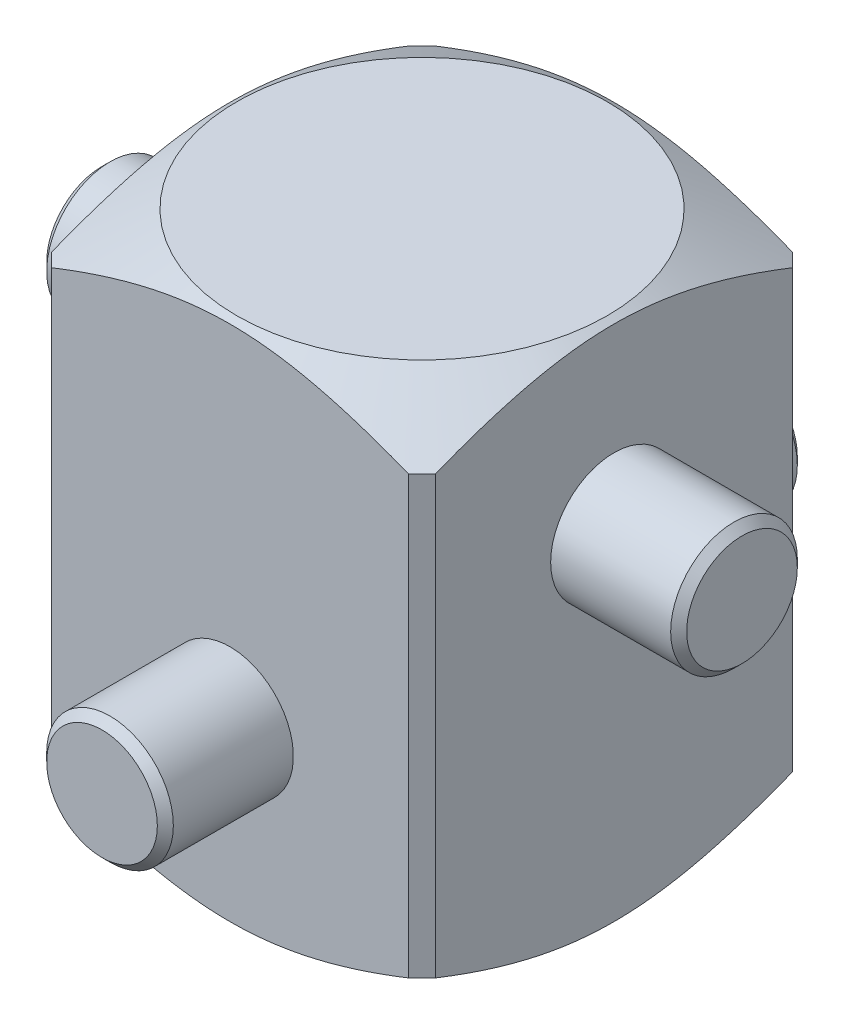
ISO-10303-21;
HEADER;
FILE_DESCRIPTION(('STEP AP214'),'2;1');
FILE_NAME('part.step','',(''),(''),'','','');
FILE_SCHEMA(('AUTOMOTIVE_DESIGN { 1 0 10303 214 1 1 1 1 }'));
ENDSEC;
DATA;
#1=APPLICATION_CONTEXT('core data for automotive mechanical design processes');
#2=APPLICATION_PROTOCOL_DEFINITION('international standard','automotive_design',2000,#1);
#3=PRODUCT_CONTEXT('',#1,'mechanical');
#4=PRODUCT('Part','Part','',(#3));
#5=PRODUCT_RELATED_PRODUCT_CATEGORY('part','',(#4));
#6=PRODUCT_DEFINITION_FORMATION('','',#4);
#7=PRODUCT_DEFINITION_CONTEXT('part definition',#1,'design');
#8=PRODUCT_DEFINITION('design','',#6,#7);
#9=PRODUCT_DEFINITION_SHAPE('','',#8);
#10=(LENGTH_UNIT() NAMED_UNIT(*) SI_UNIT(.MILLI.,.METRE.));
#11=(NAMED_UNIT(*) PLANE_ANGLE_UNIT() SI_UNIT($,.RADIAN.));
#12=(NAMED_UNIT(*) SI_UNIT($,.STERADIAN.) SOLID_ANGLE_UNIT());
#13=UNCERTAINTY_MEASURE_WITH_UNIT(LENGTH_MEASURE(1.E-05),#10,'distance_accuracy_value','');
#14=(GEOMETRIC_REPRESENTATION_CONTEXT(3) GLOBAL_UNCERTAINTY_ASSIGNED_CONTEXT((#13)) GLOBAL_UNIT_ASSIGNED_CONTEXT((#10,
#11,#12)) REPRESENTATION_CONTEXT('',''));
#15=CARTESIAN_POINT('',(0.,0.,0.));
#16=DIRECTION('',(0.,0.,1.));
#17=DIRECTION('',(1.,0.,0.));
#18=AXIS2_PLACEMENT_3D('',#15,#16,#17);
#19=CARTESIAN_POINT('',(0.,0.,0.));
#20=DIRECTION('',(0.,1.,0.));
#21=DIRECTION('',(0.,0.,1.));
#22=AXIS2_PLACEMENT_3D('',#19,#20,#21);
#23=PLANE('',#22);
#24=CARTESIAN_POINT('',(0.,0.,0.));
#25=DIRECTION('',(0.,1.,0.));
#26=DIRECTION('',(0.,0.,1.));
#27=AXIS2_PLACEMENT_3D('',#24,#25,#26);
#28=CIRCLE('',#27,6.95);
#29=CARTESIAN_POINT('',(0.,0.,6.95));
#30=VERTEX_POINT('',#29);
#31=EDGE_CURVE('E304',#30,#30,#28,.T.);
#32=ORIENTED_EDGE('',*,*,#31,.F.);
#33=EDGE_LOOP('',(#32));
#34=FACE_BOUND('',#33,.T.);
#35=ADVANCED_FACE('F35',(#34),#23,.F.);
#36=CARTESIAN_POINT('',(0.,0.,0.));
#37=DIRECTION('',(0.,1.,0.));
#38=DIRECTION('',(0.,0.,1.));
#39=AXIS2_PLACEMENT_3D('',#36,#37,#38);
#40=CONICAL_SURFACE('',#39,6.95,1.0471975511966);
#41=ORIENTED_EDGE('',*,*,#31,.T.);
#42=EDGE_LOOP('',(#41));
#43=FACE_BOUND('',#42,.T.);
#44=CARTESIAN_POINT('',(7.2,9.40464348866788,22.0958369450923));
#45=CARTESIAN_POINT('',(7.2,9.13601072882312,21.6064384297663));
#46=CARTESIAN_POINT('',(7.2,8.86800830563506,21.1166924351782));
#47=CARTESIAN_POINT('',(7.2,8.33360168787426,20.1363207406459));
#48=CARTESIAN_POINT('',(7.2,8.06719751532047,19.6456950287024));
#49=CARTESIAN_POINT('',(7.2,7.53618197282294,18.6631143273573));
#50=CARTESIAN_POINT('',(7.2,7.27157170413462,18.1711587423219));
#51=CARTESIAN_POINT('',(7.2,6.74477625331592,17.1859533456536));
#52=CARTESIAN_POINT('',(7.2,6.48259105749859,16.6927035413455));
#53=CARTESIAN_POINT('',(7.2,5.95559157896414,15.6938101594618));
#54=CARTESIAN_POINT('',(7.2,5.69084473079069,15.1881309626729));
#55=CARTESIAN_POINT('',(7.2,5.16547639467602,14.1746342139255));
#56=CARTESIAN_POINT('',(7.2,4.90485487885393,13.6668166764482));
#57=CARTESIAN_POINT('',(7.2,4.38911987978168,12.6485437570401));
#58=CARTESIAN_POINT('',(7.2,4.13400506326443,12.138089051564));
#59=CARTESIAN_POINT('',(7.2,3.63111820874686,11.1135768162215));
#60=CARTESIAN_POINT('',(7.2,3.38334591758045,10.5995194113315));
#61=CARTESIAN_POINT('',(7.2,3.01638902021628,9.81849541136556));
#62=CARTESIAN_POINT('',(7.2,2.89342989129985,9.55330248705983));
#63=CARTESIAN_POINT('',(7.2,2.6507441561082,9.0214435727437));
#64=CARTESIAN_POINT('',(7.2,2.53101749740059,8.75477760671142));
#65=CARTESIAN_POINT('',(7.2,2.29541817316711,8.21965045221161));
#66=CARTESIAN_POINT('',(7.2,2.17954665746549,7.95118875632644));
#67=CARTESIAN_POINT('',(7.2,1.95253012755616,7.4122697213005));
#68=CARTESIAN_POINT('',(7.2,1.84138509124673,7.14181239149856));
#69=CARTESIAN_POINT('',(7.2,1.62534048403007,6.5997634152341));
#70=CARTESIAN_POINT('',(7.2,1.52041592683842,6.32818176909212));
#71=CARTESIAN_POINT('',(7.2,1.31759199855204,5.78238477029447));
#72=CARTESIAN_POINT('',(7.2,1.21969288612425,5.50816932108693));
#73=CARTESIAN_POINT('',(7.2,1.03256983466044,4.95685778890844));
#74=CARTESIAN_POINT('',(7.2,0.943343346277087,4.67976257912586));
#75=CARTESIAN_POINT('',(7.2,0.775514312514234,4.12240485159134));
#76=CARTESIAN_POINT('',(7.2,0.696910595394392,3.8421426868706));
#77=CARTESIAN_POINT('',(7.2,0.524132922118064,3.1669342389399));
#78=CARTESIAN_POINT('',(7.2,0.43605108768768,2.77036569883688));
#79=CARTESIAN_POINT('',(7.2,0.327861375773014,2.17127022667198));
#80=CARTESIAN_POINT('',(7.2,0.295787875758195,1.97087366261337));
#81=CARTESIAN_POINT('',(7.2,0.240388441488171,1.56888447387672));
#82=CARTESIAN_POINT('',(7.2,0.217061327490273,1.3672920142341));
#83=CARTESIAN_POINT('',(7.2,0.179889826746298,0.964297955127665));
#84=CARTESIAN_POINT('',(7.2,0.165996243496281,0.762900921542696));
#85=CARTESIAN_POINT('',(7.2,0.147903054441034,0.359670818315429));
#86=CARTESIAN_POINT('',(7.2,0.143703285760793,0.157837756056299));
#87=CARTESIAN_POINT('',(7.2,0.145126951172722,-0.24579826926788));
#88=CARTESIAN_POINT('',(7.2,0.15075057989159,-0.44760123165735));
#89=CARTESIAN_POINT('',(7.2,0.171647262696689,-0.850706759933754));
#90=CARTESIAN_POINT('',(7.2,0.186920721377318,-1.05200930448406));
#91=CARTESIAN_POINT('',(7.2,0.232895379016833,-1.51647387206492));
#92=CARTESIAN_POINT('',(7.2,0.266926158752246,-1.77930895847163));
#93=CARTESIAN_POINT('',(7.2,0.349335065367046,-2.30271695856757));
#94=CARTESIAN_POINT('',(7.2,0.397715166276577,-2.56328955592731));
#95=CARTESIAN_POINT('',(7.2,0.507016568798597,-3.08200651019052));
#96=CARTESIAN_POINT('',(7.2,0.567949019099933,-3.3401484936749));
#97=CARTESIAN_POINT('',(7.2,0.700443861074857,-3.85365876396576));
#98=CARTESIAN_POINT('',(7.2,0.772006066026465,-4.10902709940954));
#99=CARTESIAN_POINT('',(7.2,0.925560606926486,-4.62222548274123));
#100=CARTESIAN_POINT('',(7.2,1.00773471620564,-4.88000075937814));
#101=CARTESIAN_POINT('',(7.2,1.17973487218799,-5.39297081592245));
#102=CARTESIAN_POINT('',(7.2,1.26956094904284,-5.64816558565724));
#103=CARTESIAN_POINT('',(7.2,1.45548280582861,-6.15612203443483));
#104=CARTESIAN_POINT('',(7.2,1.55157578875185,-6.40888474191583));
#105=CARTESIAN_POINT('',(7.2,1.74897070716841,-6.91235682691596));
#106=CARTESIAN_POINT('',(7.2,1.85027259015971,-7.16306622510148));
#107=CARTESIAN_POINT('',(7.2,2.09043445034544,-7.74296314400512));
#108=CARTESIAN_POINT('',(7.2,2.2309037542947,-8.07148306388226));
#109=CARTESIAN_POINT('',(7.2,2.5177697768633,-8.7259315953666));
#110=CARTESIAN_POINT('',(7.2,2.6641667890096,-9.05186007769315));
#111=CARTESIAN_POINT('',(7.2,2.96170151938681,-9.70160460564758));
#112=CARTESIAN_POINT('',(7.2,3.11284000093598,-10.0254203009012));
#113=CARTESIAN_POINT('',(7.2,3.41891748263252,-10.6712534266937));
#114=CARTESIAN_POINT('',(7.2,3.57385654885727,-10.9932708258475));
#115=CARTESIAN_POINT('',(7.2,3.8869682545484,-11.6360903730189));
#116=CARTESIAN_POINT('',(7.2,4.04514371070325,-11.9568911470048));
#117=CARTESIAN_POINT('',(7.2,4.36404691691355,-12.5972226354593));
#118=CARTESIAN_POINT('',(7.2,4.52477468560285,-12.9167533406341));
#119=CARTESIAN_POINT('',(7.2,5.01008075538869,-13.8736744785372));
#120=CARTESIAN_POINT('',(7.2,5.33781604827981,-14.5094636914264));
#121=CARTESIAN_POINT('',(7.2,5.97293226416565,-15.7274938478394));
#122=CARTESIAN_POINT('',(7.2,6.27985925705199,-16.3099724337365));
#123=CARTESIAN_POINT('',(7.2,6.89752143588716,-17.472927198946));
#124=CARTESIAN_POINT('',(7.19999999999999,7.20825673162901,-18.0534033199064));
#125=CARTESIAN_POINT('',(7.19999999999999,7.83198566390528,-19.2115879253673));
#126=CARTESIAN_POINT('',(7.19999999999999,8.14497328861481,-19.7892996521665));
#127=CARTESIAN_POINT('',(7.19999999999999,8.7732365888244,-20.9434440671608));
#128=CARTESIAN_POINT('',(7.19999999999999,9.08851215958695,-21.5198768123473));
#129=CARTESIAN_POINT('',(7.19999999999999,9.40464348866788,-22.0958369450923));
#130=B_SPLINE_CURVE_WITH_KNOTS('',3,(#44,#45,#46,#47,#48,#49,#50,#51,#52,#53,#54,#55,#56,#57,
#58,#59,#60,#61,#62,#63,#64,#65,#66,#67,#68,#69,#70,#71,#72,#73,#74,#75,#76,#77,#78,#79,#80,#81,
#82,#83,#84,#85,#86,#87,#88,#89,#90,#91,#92,#93,#94,#95,#96,#97,#98,#99,#100,#101,#102,#103,
#104,#105,#106,#107,#108,#109,#110,#111,#112,#113,#114,#115,#116,#117,#118,#119,#120,#121,#122,
#123,#124,#125,#126,#127,#128,#129),.UNSPECIFIED.,.F.,.F.,(4,2,2,2,2,2,2,2,2,2,2,2,2,2,2,2,2,2,
2,2,2,2,2,2,2,2,2,2,2,2,2,2,2,2,2,2,2,2,2,2,2,2,4),(0.,1.67483586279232,3.3496947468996,
5.02550254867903,6.70130088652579,8.41365974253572,10.1260070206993,11.8379349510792,
13.5498037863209,14.4267225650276,15.3036271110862,16.1807908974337,17.0579505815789,
17.9313076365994,18.8046968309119,19.6778285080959,20.5508637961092,21.7683390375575,
22.377022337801,22.9856235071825,23.5910258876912,24.1964180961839,24.8018222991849,
25.4072518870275,26.2018741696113,26.9966058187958,27.7920463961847,28.587473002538,
29.3989972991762,30.2105247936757,31.0216925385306,31.8328521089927,32.9046467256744,
33.976494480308,35.048515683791,36.1205555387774,37.1935718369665,38.2665959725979,
40.4124111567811,42.3875844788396,44.3628148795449,46.3339534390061,48.3050023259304),.UNSPECIFIED.);
#131=CARTESIAN_POINT('',(7.2,1.66573697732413,6.7));
#132=VERTEX_POINT('',#131);
#133=CARTESIAN_POINT('',(7.2,1.66573697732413,-6.7));
#134=VERTEX_POINT('',#133);
#135=EDGE_CURVE('E110',#132,#134,#130,.T.);
#136=ORIENTED_EDGE('',*,*,#135,.F.);
#137=CARTESIAN_POINT('',(7.2,1.66573697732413,6.7));
#138=CARTESIAN_POINT('',(7.11666666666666,1.66329023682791,6.78333333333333));
#139=CARTESIAN_POINT('',(7.03333333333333,1.6620668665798,6.86666666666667));
#140=CARTESIAN_POINT('',(6.86666666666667,1.6620668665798,7.03333333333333));
#141=CARTESIAN_POINT('',(6.78333333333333,1.66329023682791,7.11666666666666));
#142=CARTESIAN_POINT('',(6.7,1.66573697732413,7.2));
#143=B_SPLINE_CURVE_WITH_KNOTS('',3,(#137,#138,#139,#140,#141,#142),.UNSPECIFIED.,.F.,.F.,(4,2,
4),(0.,0.353572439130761,0.707144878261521),.UNSPECIFIED.);
#144=CARTESIAN_POINT('',(6.7,1.66573697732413,7.2));
#145=VERTEX_POINT('',#144);
#146=EDGE_CURVE('E208',#132,#145,#143,.T.);
#147=ORIENTED_EDGE('',*,*,#146,.T.);
#148=CARTESIAN_POINT('',(-22.0958369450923,9.40464348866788,7.2));
#149=CARTESIAN_POINT('',(-21.6064384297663,9.13601072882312,7.2));
#150=CARTESIAN_POINT('',(-21.1166924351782,8.86800830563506,7.2));
#151=CARTESIAN_POINT('',(-20.1363207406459,8.33360168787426,7.2));
#152=CARTESIAN_POINT('',(-19.6456950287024,8.06719751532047,7.2));
#153=CARTESIAN_POINT('',(-18.6631143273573,7.53618197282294,7.2));
#154=CARTESIAN_POINT('',(-18.1711587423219,7.27157170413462,7.2));
#155=CARTESIAN_POINT('',(-17.1859533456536,6.74477625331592,7.2));
#156=CARTESIAN_POINT('',(-16.6927035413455,6.48259105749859,7.2));
#157=CARTESIAN_POINT('',(-15.6938101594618,5.95559157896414,7.2));
#158=CARTESIAN_POINT('',(-15.1881309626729,5.69084473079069,7.2));
#159=CARTESIAN_POINT('',(-14.1746342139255,5.16547639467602,7.2));
#160=CARTESIAN_POINT('',(-13.6668166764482,4.90485487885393,7.2));
#161=CARTESIAN_POINT('',(-12.6485437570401,4.38911987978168,7.2));
#162=CARTESIAN_POINT('',(-12.138089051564,4.13400506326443,7.2));
#163=CARTESIAN_POINT('',(-11.1135768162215,3.63111820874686,7.2));
#164=CARTESIAN_POINT('',(-10.5995194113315,3.38334591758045,7.2));
#165=CARTESIAN_POINT('',(-9.81849541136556,3.01638902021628,7.2));
#166=CARTESIAN_POINT('',(-9.55330248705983,2.89342989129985,7.2));
#167=CARTESIAN_POINT('',(-9.0214435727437,2.6507441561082,7.2));
#168=CARTESIAN_POINT('',(-8.75477760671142,2.53101749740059,7.2));
#169=CARTESIAN_POINT('',(-8.21965045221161,2.29541817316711,7.2));
#170=CARTESIAN_POINT('',(-7.95118875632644,2.17954665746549,7.2));
#171=CARTESIAN_POINT('',(-7.4122697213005,1.95253012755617,7.2));
#172=CARTESIAN_POINT('',(-7.14181239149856,1.84138509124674,7.2));
#173=CARTESIAN_POINT('',(-6.59976341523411,1.62534048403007,7.2));
#174=CARTESIAN_POINT('',(-6.32818176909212,1.52041592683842,7.2));
#175=CARTESIAN_POINT('',(-5.78238477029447,1.31759199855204,7.2));
#176=CARTESIAN_POINT('',(-5.50816932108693,1.21969288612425,7.2));
#177=CARTESIAN_POINT('',(-4.95685778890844,1.03256983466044,7.2));
#178=CARTESIAN_POINT('',(-4.67976257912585,0.943343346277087,7.2));
#179=CARTESIAN_POINT('',(-4.12240485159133,0.775514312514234,7.2));
#180=CARTESIAN_POINT('',(-3.84214268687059,0.696910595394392,7.2));
#181=CARTESIAN_POINT('',(-3.1669342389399,0.524132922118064,7.2));
#182=CARTESIAN_POINT('',(-2.77036569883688,0.436051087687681,7.2));
#183=CARTESIAN_POINT('',(-2.17127022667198,0.327861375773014,7.2));
#184=CARTESIAN_POINT('',(-1.97087366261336,0.295787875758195,7.2));
#185=CARTESIAN_POINT('',(-1.56888447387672,0.240388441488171,7.2));
#186=CARTESIAN_POINT('',(-1.3672920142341,0.217061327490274,7.2));
#187=CARTESIAN_POINT('',(-0.964297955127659,0.179889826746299,7.2));
#188=CARTESIAN_POINT('',(-0.76290092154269,0.165996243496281,7.2));
#189=CARTESIAN_POINT('',(-0.359670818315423,0.147903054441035,7.2));
#190=CARTESIAN_POINT('',(-0.157837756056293,0.143703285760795,7.2));
#191=CARTESIAN_POINT('',(0.245798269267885,0.145126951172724,7.2));
#192=CARTESIAN_POINT('',(0.447601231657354,0.150750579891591,7.2));
#193=CARTESIAN_POINT('',(0.850706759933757,0.17164726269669,7.2));
#194=CARTESIAN_POINT('',(1.05200930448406,0.186920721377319,7.2));
#195=CARTESIAN_POINT('',(1.51647387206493,0.232895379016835,7.2));
#196=CARTESIAN_POINT('',(1.77930895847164,0.266926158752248,7.2));
#197=CARTESIAN_POINT('',(2.30271695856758,0.349335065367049,7.2));
#198=CARTESIAN_POINT('',(2.56328955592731,0.39771516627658,7.2));
#199=CARTESIAN_POINT('',(3.08200651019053,0.507016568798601,7.2));
#200=CARTESIAN_POINT('',(3.3401484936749,0.567949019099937,7.2));
#201=CARTESIAN_POINT('',(3.85365876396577,0.700443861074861,7.2));
#202=CARTESIAN_POINT('',(4.10902709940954,0.772006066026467,7.2));
#203=CARTESIAN_POINT('',(4.62222548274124,0.925560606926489,7.2));
#204=CARTESIAN_POINT('',(4.88000075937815,1.00773471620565,7.2));
#205=CARTESIAN_POINT('',(5.39297081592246,1.179734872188,7.2));
#206=CARTESIAN_POINT('',(5.64816558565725,1.26956094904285,7.2));
#207=CARTESIAN_POINT('',(6.15612203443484,1.45548280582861,7.2));
#208=CARTESIAN_POINT('',(6.40888474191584,1.55157578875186,7.2));
#209=CARTESIAN_POINT('',(6.91235682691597,1.74897070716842,7.2));
#210=CARTESIAN_POINT('',(7.16306622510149,1.85027259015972,7.2));
#211=CARTESIAN_POINT('',(7.74296314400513,2.09043445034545,7.2));
#212=CARTESIAN_POINT('',(8.07148306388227,2.23090375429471,7.2));
#213=CARTESIAN_POINT('',(8.72593159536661,2.51776977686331,7.2));
#214=CARTESIAN_POINT('',(9.05186007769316,2.66416678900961,7.2));
#215=CARTESIAN_POINT('',(9.70160460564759,2.96170151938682,7.2));
#216=CARTESIAN_POINT('',(10.0254203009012,3.11284000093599,7.2));
#217=CARTESIAN_POINT('',(10.6712534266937,3.41891748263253,7.2));
#218=CARTESIAN_POINT('',(10.9932708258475,3.57385654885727,7.2));
#219=CARTESIAN_POINT('',(11.6360903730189,3.88696825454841,7.2));
#220=CARTESIAN_POINT('',(11.9568911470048,4.04514371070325,7.2));
#221=CARTESIAN_POINT('',(12.5972226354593,4.36404691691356,7.2));
#222=CARTESIAN_POINT('',(12.9167533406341,4.52477468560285,7.2));
#223=CARTESIAN_POINT('',(13.8736744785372,5.01008075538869,7.2));
#224=CARTESIAN_POINT('',(14.5094636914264,5.33781604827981,7.2));
#225=CARTESIAN_POINT('',(15.7274938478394,5.97293226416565,7.2));
#226=CARTESIAN_POINT('',(16.3099724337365,6.27985925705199,7.2));
#227=CARTESIAN_POINT('',(17.472927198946,6.89752143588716,7.2));
#228=CARTESIAN_POINT('',(18.0534033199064,7.20825673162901,7.2));
#229=CARTESIAN_POINT('',(19.2115879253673,7.83198566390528,7.2));
#230=CARTESIAN_POINT('',(19.7892996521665,8.14497328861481,7.2));
#231=CARTESIAN_POINT('',(20.9434440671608,8.7732365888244,7.2));
#232=CARTESIAN_POINT('',(21.5198768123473,9.08851215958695,7.2));
#233=CARTESIAN_POINT('',(22.0958369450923,9.40464348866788,7.2));
#234=B_SPLINE_CURVE_WITH_KNOTS('',3,(#148,#149,#150,#151,#152,#153,#154,#155,#156,#157,#158,
#159,#160,#161,#162,#163,#164,#165,#166,#167,#168,#169,#170,#171,#172,#173,#174,#175,#176,#177,
#178,#179,#180,#181,#182,#183,#184,#185,#186,#187,#188,#189,#190,#191,#192,#193,#194,#195,#196,
#197,#198,#199,#200,#201,#202,#203,#204,#205,#206,#207,#208,#209,#210,#211,#212,#213,#214,#215,
#216,#217,#218,#219,#220,#221,#222,#223,#224,#225,#226,#227,#228,#229,#230,#231,#232,#233),
.UNSPECIFIED.,.F.,.F.,(4,2,2,2,2,2,2,2,2,2,2,2,2,2,2,2,2,2,2,2,2,2,2,2,2,2,2,2,2,2,2,2,2,2,2,2,
2,2,2,2,2,2,4),(0.,1.67483586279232,3.3496947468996,5.02550254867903,6.70130088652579,
8.41365974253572,10.1260070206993,11.8379349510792,13.5498037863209,14.4267225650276,
15.3036271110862,16.1807908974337,17.0579505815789,17.9313076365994,18.8046968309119,
19.6778285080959,20.5508637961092,21.7683390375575,22.377022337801,22.9856235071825,
23.5910258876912,24.1964180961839,24.8018222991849,25.4072518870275,26.2018741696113,
26.9966058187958,27.7920463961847,28.587473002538,29.3989972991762,30.2105247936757,
31.0216925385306,31.8328521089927,32.9046467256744,33.976494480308,35.048515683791,
36.1205555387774,37.1935718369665,38.2665959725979,40.4124111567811,42.3875844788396,
44.3628148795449,46.3339534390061,48.3050023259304),.UNSPECIFIED.);
#235=CARTESIAN_POINT('',(-6.69999999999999,1.66573697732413,7.2));
#236=VERTEX_POINT('',#235);
#237=EDGE_CURVE('E281',#236,#145,#234,.T.);
#238=ORIENTED_EDGE('',*,*,#237,.F.);
#239=CARTESIAN_POINT('',(-6.7,1.66573697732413,7.2));
#240=CARTESIAN_POINT('',(-6.78333333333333,1.66329023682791,7.11666666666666));
#241=CARTESIAN_POINT('',(-6.86666666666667,1.6620668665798,7.03333333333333));
#242=CARTESIAN_POINT('',(-7.03333333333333,1.6620668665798,6.86666666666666));
#243=CARTESIAN_POINT('',(-7.11666666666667,1.66329023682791,6.78333333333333));
#244=CARTESIAN_POINT('',(-7.2,1.66573697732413,6.7));
#245=B_SPLINE_CURVE_WITH_KNOTS('',3,(#239,#240,#241,#242,#243,#244),.UNSPECIFIED.,.F.,.F.,(4,2,
4),(0.,0.353572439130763,0.707144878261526),.UNSPECIFIED.);
#246=CARTESIAN_POINT('',(-7.2,1.66573697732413,6.7));
#247=VERTEX_POINT('',#246);
#248=EDGE_CURVE('E351',#236,#247,#245,.T.);
#249=ORIENTED_EDGE('',*,*,#248,.T.);
#250=CARTESIAN_POINT('',(-7.2,9.40464348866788,-22.0958369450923));
#251=CARTESIAN_POINT('',(-7.2,9.13601072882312,-21.6064384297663));
#252=CARTESIAN_POINT('',(-7.2,8.86800830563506,-21.1166924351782));
#253=CARTESIAN_POINT('',(-7.2,8.33360168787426,-20.1363207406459));
#254=CARTESIAN_POINT('',(-7.2,8.06719751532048,-19.6456950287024));
#255=CARTESIAN_POINT('',(-7.2,7.53618197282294,-18.6631143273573));
#256=CARTESIAN_POINT('',(-7.2,7.27157170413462,-18.1711587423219));
#257=CARTESIAN_POINT('',(-7.2,6.74477625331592,-17.1859533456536));
#258=CARTESIAN_POINT('',(-7.2,6.48259105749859,-16.6927035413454));
#259=CARTESIAN_POINT('',(-7.2,5.95559157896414,-15.6938101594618));
#260=CARTESIAN_POINT('',(-7.2,5.69084473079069,-15.1881309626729));
#261=CARTESIAN_POINT('',(-7.2,5.16547639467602,-14.1746342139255));
#262=CARTESIAN_POINT('',(-7.2,4.90485487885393,-13.6668166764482));
#263=CARTESIAN_POINT('',(-7.2,4.38911987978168,-12.6485437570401));
#264=CARTESIAN_POINT('',(-7.2,4.13400506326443,-12.138089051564));
#265=CARTESIAN_POINT('',(-7.2,3.63111820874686,-11.1135768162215));
#266=CARTESIAN_POINT('',(-7.2,3.38334591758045,-10.5995194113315));
#267=CARTESIAN_POINT('',(-7.2,3.01638902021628,-9.81849541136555));
#268=CARTESIAN_POINT('',(-7.2,2.89342989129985,-9.55330248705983));
#269=CARTESIAN_POINT('',(-7.2,2.6507441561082,-9.02144357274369));
#270=CARTESIAN_POINT('',(-7.2,2.53101749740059,-8.75477760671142));
#271=CARTESIAN_POINT('',(-7.2,2.29541817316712,-8.21965045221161));
#272=CARTESIAN_POINT('',(-7.2,2.17954665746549,-7.95118875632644));
#273=CARTESIAN_POINT('',(-7.2,1.95253012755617,-7.4122697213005));
#274=CARTESIAN_POINT('',(-7.2,1.84138509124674,-7.14181239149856));
#275=CARTESIAN_POINT('',(-7.2,1.62534048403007,-6.5997634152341));
#276=CARTESIAN_POINT('',(-7.2,1.52041592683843,-6.32818176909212));
#277=CARTESIAN_POINT('',(-7.2,1.31759199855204,-5.78238477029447));
#278=CARTESIAN_POINT('',(-7.2,1.21969288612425,-5.50816932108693));
#279=CARTESIAN_POINT('',(-7.2,1.03256983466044,-4.95685778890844));
#280=CARTESIAN_POINT('',(-7.2,0.943343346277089,-4.67976257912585));
#281=CARTESIAN_POINT('',(-7.2,0.775514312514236,-4.12240485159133));
#282=CARTESIAN_POINT('',(-7.2,0.696910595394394,-3.84214268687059));
#283=CARTESIAN_POINT('',(-7.2,0.524132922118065,-3.1669342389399));
#284=CARTESIAN_POINT('',(-7.2,0.436051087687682,-2.77036569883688));
#285=CARTESIAN_POINT('',(-7.2,0.327861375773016,-2.17127022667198));
#286=CARTESIAN_POINT('',(-7.2,0.295787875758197,-1.97087366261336));
#287=CARTESIAN_POINT('',(-7.2,0.240388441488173,-1.56888447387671));
#288=CARTESIAN_POINT('',(-7.2,0.217061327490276,-1.3672920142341));
#289=CARTESIAN_POINT('',(-7.2,0.179889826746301,-0.964297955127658));
#290=CARTESIAN_POINT('',(-7.2,0.165996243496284,-0.762900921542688));
#291=CARTESIAN_POINT('',(-7.2,0.147903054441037,-0.359670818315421));
#292=CARTESIAN_POINT('',(-7.2,0.143703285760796,-0.157837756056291));
#293=CARTESIAN_POINT('',(-7.2,0.145126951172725,0.245798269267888));
#294=CARTESIAN_POINT('',(-7.2,0.150750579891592,0.447601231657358));
#295=CARTESIAN_POINT('',(-7.2,0.171647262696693,0.850706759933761));
#296=CARTESIAN_POINT('',(-7.2,0.186920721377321,1.05200930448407));
#297=CARTESIAN_POINT('',(-7.2,0.232895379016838,1.51647387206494));
#298=CARTESIAN_POINT('',(-7.2,0.26692615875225,1.77930895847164));
#299=CARTESIAN_POINT('',(-7.2,0.349335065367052,2.30271695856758));
#300=CARTESIAN_POINT('',(-7.2,0.397715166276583,2.56328955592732));
#301=CARTESIAN_POINT('',(-7.2,0.507016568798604,3.08200651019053));
#302=CARTESIAN_POINT('',(-7.2,0.56794901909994,3.34014849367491));
#303=CARTESIAN_POINT('',(-7.2,0.700443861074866,3.85365876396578));
#304=CARTESIAN_POINT('',(-7.2,0.772006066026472,4.10902709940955));
#305=CARTESIAN_POINT('',(-7.2,0.925560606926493,4.62222548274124));
#306=CARTESIAN_POINT('',(-7.2,1.00773471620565,4.88000075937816));
#307=CARTESIAN_POINT('',(-7.2,1.179734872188,5.39297081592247));
#308=CARTESIAN_POINT('',(-7.2,1.26956094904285,5.64816558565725));
#309=CARTESIAN_POINT('',(-7.2,1.45548280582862,6.15612203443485));
#310=CARTESIAN_POINT('',(-7.2,1.55157578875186,6.40888474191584));
#311=CARTESIAN_POINT('',(-7.2,1.74897070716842,6.91235682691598));
#312=CARTESIAN_POINT('',(-7.2,1.85027259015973,7.1630662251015));
#313=CARTESIAN_POINT('',(-7.2,2.09043445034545,7.74296314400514));
#314=CARTESIAN_POINT('',(-7.2,2.23090375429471,8.07148306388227));
#315=CARTESIAN_POINT('',(-7.2,2.51776977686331,8.72593159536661));
#316=CARTESIAN_POINT('',(-7.2,2.66416678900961,9.05186007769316));
#317=CARTESIAN_POINT('',(-7.2,2.96170151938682,9.70160460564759));
#318=CARTESIAN_POINT('',(-7.2,3.11284000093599,10.0254203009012));
#319=CARTESIAN_POINT('',(-7.2,3.41891748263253,10.6712534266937));
#320=CARTESIAN_POINT('',(-7.2,3.57385654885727,10.9932708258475));
#321=CARTESIAN_POINT('',(-7.2,3.88696825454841,11.6360903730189));
#322=CARTESIAN_POINT('',(-7.2,4.04514371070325,11.9568911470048));
#323=CARTESIAN_POINT('',(-7.2,4.36404691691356,12.5972226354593));
#324=CARTESIAN_POINT('',(-7.2,4.52477468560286,12.9167533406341));
#325=CARTESIAN_POINT('',(-7.2,5.01008075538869,13.8736744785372));
#326=CARTESIAN_POINT('',(-7.2,5.33781604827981,14.5094636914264));
#327=CARTESIAN_POINT('',(-7.2,5.97293226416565,15.7274938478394));
#328=CARTESIAN_POINT('',(-7.2,6.27985925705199,16.3099724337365));
#329=CARTESIAN_POINT('',(-7.2,6.89752143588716,17.472927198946));
#330=CARTESIAN_POINT('',(-7.2,7.20825673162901,18.0534033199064));
#331=CARTESIAN_POINT('',(-7.2,7.83198566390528,19.2115879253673));
#332=CARTESIAN_POINT('',(-7.2,8.14497328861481,19.7892996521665));
#333=CARTESIAN_POINT('',(-7.2,8.7732365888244,20.9434440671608));
#334=CARTESIAN_POINT('',(-7.2,9.08851215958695,21.5198768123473));
#335=CARTESIAN_POINT('',(-7.2,9.40464348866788,22.0958369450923));
#336=B_SPLINE_CURVE_WITH_KNOTS('',3,(#250,#251,#252,#253,#254,#255,#256,#257,#258,#259,#260,
#261,#262,#263,#264,#265,#266,#267,#268,#269,#270,#271,#272,#273,#274,#275,#276,#277,#278,#279,
#280,#281,#282,#283,#284,#285,#286,#287,#288,#289,#290,#291,#292,#293,#294,#295,#296,#297,#298,
#299,#300,#301,#302,#303,#304,#305,#306,#307,#308,#309,#310,#311,#312,#313,#314,#315,#316,#317,
#318,#319,#320,#321,#322,#323,#324,#325,#326,#327,#328,#329,#330,#331,#332,#333,#334,#335),
.UNSPECIFIED.,.F.,.F.,(4,2,2,2,2,2,2,2,2,2,2,2,2,2,2,2,2,2,2,2,2,2,2,2,2,2,2,2,2,2,2,2,2,2,2,2,
2,2,2,2,2,2,4),(0.,1.67483586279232,3.34969474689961,5.02550254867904,6.7013008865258,
8.41365974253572,10.1260070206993,11.8379349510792,13.5498037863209,14.4267225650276,
15.3036271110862,16.1807908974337,17.0579505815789,17.9313076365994,18.8046968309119,
19.6778285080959,20.5508637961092,21.7683390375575,22.377022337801,22.9856235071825,
23.5910258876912,24.1964180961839,24.8018222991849,25.4072518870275,26.2018741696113,
26.9966058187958,27.7920463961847,28.587473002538,29.3989972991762,30.2105247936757,
31.0216925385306,31.8328521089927,32.9046467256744,33.976494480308,35.048515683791,
36.1205555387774,37.1935718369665,38.2665959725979,40.4124111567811,42.3875844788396,
44.3628148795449,46.3339534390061,48.3050023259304),.UNSPECIFIED.);
#337=CARTESIAN_POINT('',(-7.2,1.66573697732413,-6.7));
#338=VERTEX_POINT('',#337);
#339=EDGE_CURVE('E275',#338,#247,#336,.T.);
#340=ORIENTED_EDGE('',*,*,#339,.F.);
#341=CARTESIAN_POINT('',(-7.2,1.66573697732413,-6.7));
#342=CARTESIAN_POINT('',(-7.11666666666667,1.66329023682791,-6.78333333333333));
#343=CARTESIAN_POINT('',(-7.03333333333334,1.6620668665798,-6.86666666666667));
#344=CARTESIAN_POINT('',(-6.86666666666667,1.6620668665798,-7.03333333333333));
#345=CARTESIAN_POINT('',(-6.78333333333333,1.66329023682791,-7.11666666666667));
#346=CARTESIAN_POINT('',(-6.7,1.66573697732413,-7.2));
#347=B_SPLINE_CURVE_WITH_KNOTS('',3,(#341,#342,#343,#344,#345,#346),.UNSPECIFIED.,.F.,.F.,(4,2,
4),(0.,0.353572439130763,0.707144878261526),.UNSPECIFIED.);
#348=CARTESIAN_POINT('',(-6.7,1.66573697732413,-7.2));
#349=VERTEX_POINT('',#348);
#350=EDGE_CURVE('E346',#338,#349,#347,.T.);
#351=ORIENTED_EDGE('',*,*,#350,.T.);
#352=CARTESIAN_POINT('',(22.0958369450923,9.40464348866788,-7.2));
#353=CARTESIAN_POINT('',(21.6064384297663,9.13601072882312,-7.2));
#354=CARTESIAN_POINT('',(21.1166924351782,8.86800830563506,-7.2));
#355=CARTESIAN_POINT('',(20.1363207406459,8.33360168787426,-7.2));
#356=CARTESIAN_POINT('',(19.6456950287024,8.06719751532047,-7.2));
#357=CARTESIAN_POINT('',(18.6631143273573,7.53618197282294,-7.2));
#358=CARTESIAN_POINT('',(18.1711587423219,7.27157170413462,-7.2));
#359=CARTESIAN_POINT('',(17.1859533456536,6.74477625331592,-7.2));
#360=CARTESIAN_POINT('',(16.6927035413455,6.48259105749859,-7.2));
#361=CARTESIAN_POINT('',(15.6938101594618,5.95559157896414,-7.2));
#362=CARTESIAN_POINT('',(15.1881309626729,5.69084473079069,-7.2));
#363=CARTESIAN_POINT('',(14.1746342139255,5.16547639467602,-7.2));
#364=CARTESIAN_POINT('',(13.6668166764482,4.90485487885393,-7.2));
#365=CARTESIAN_POINT('',(12.6485437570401,4.38911987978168,-7.2));
#366=CARTESIAN_POINT('',(12.138089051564,4.13400506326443,-7.2));
#367=CARTESIAN_POINT('',(11.1135768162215,3.63111820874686,-7.2));
#368=CARTESIAN_POINT('',(10.5995194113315,3.38334591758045,-7.2));
#369=CARTESIAN_POINT('',(9.81849541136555,3.01638902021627,-7.2));
#370=CARTESIAN_POINT('',(9.55330248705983,2.89342989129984,-7.2));
#371=CARTESIAN_POINT('',(9.02144357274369,2.6507441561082,-7.2));
#372=CARTESIAN_POINT('',(8.75477760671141,2.53101749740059,-7.2));
#373=CARTESIAN_POINT('',(8.21965045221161,2.29541817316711,-7.2));
#374=CARTESIAN_POINT('',(7.95118875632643,2.17954665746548,-7.2));
#375=CARTESIAN_POINT('',(7.41226972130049,1.95253012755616,-7.2));
#376=CARTESIAN_POINT('',(7.14181239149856,1.84138509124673,-7.2));
#377=CARTESIAN_POINT('',(6.5997634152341,1.62534048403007,-7.2));
#378=CARTESIAN_POINT('',(6.32818176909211,1.52041592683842,-7.2));
#379=CARTESIAN_POINT('',(5.78238477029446,1.31759199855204,-7.2));
#380=CARTESIAN_POINT('',(5.50816932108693,1.21969288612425,-7.2));
#381=CARTESIAN_POINT('',(4.95685778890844,1.03256983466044,-7.2));
#382=CARTESIAN_POINT('',(4.67976257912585,0.943343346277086,-7.2));
#383=CARTESIAN_POINT('',(4.12240485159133,0.775514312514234,-7.2));
#384=CARTESIAN_POINT('',(3.84214268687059,0.696910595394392,-7.2));
#385=CARTESIAN_POINT('',(3.1669342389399,0.524132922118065,-7.2));
#386=CARTESIAN_POINT('',(2.77036569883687,0.43605108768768,-7.2));
#387=CARTESIAN_POINT('',(2.17127022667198,0.327861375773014,-7.2));
#388=CARTESIAN_POINT('',(1.97087366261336,0.295787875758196,-7.2));
#389=CARTESIAN_POINT('',(1.56888447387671,0.240388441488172,-7.2));
#390=CARTESIAN_POINT('',(1.3672920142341,0.217061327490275,-7.2));
#391=CARTESIAN_POINT('',(0.964297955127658,0.1798898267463,-7.2));
#392=CARTESIAN_POINT('',(0.762900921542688,0.165996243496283,-7.2));
#393=CARTESIAN_POINT('',(0.359670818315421,0.147903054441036,-7.2));
#394=CARTESIAN_POINT('',(0.157837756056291,0.143703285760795,-7.2));
#395=CARTESIAN_POINT('',(-0.245798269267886,0.145126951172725,-7.2));
#396=CARTESIAN_POINT('',(-0.447601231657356,0.150750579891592,-7.2));
#397=CARTESIAN_POINT('',(-0.850706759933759,0.171647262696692,-7.2));
#398=CARTESIAN_POINT('',(-1.05200930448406,0.186920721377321,-7.2));
#399=CARTESIAN_POINT('',(-1.51647387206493,0.232895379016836,-7.2));
#400=CARTESIAN_POINT('',(-1.77930895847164,0.266926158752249,-7.2));
#401=CARTESIAN_POINT('',(-2.30271695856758,0.34933506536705,-7.2));
#402=CARTESIAN_POINT('',(-2.56328955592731,0.397715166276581,-7.2));
#403=CARTESIAN_POINT('',(-3.08200651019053,0.507016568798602,-7.2));
#404=CARTESIAN_POINT('',(-3.34014849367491,0.567949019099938,-7.2));
#405=CARTESIAN_POINT('',(-3.85365876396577,0.700443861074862,-7.2));
#406=CARTESIAN_POINT('',(-4.10902709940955,0.772006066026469,-7.2));
#407=CARTESIAN_POINT('',(-4.62222548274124,0.92556060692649,-7.2));
#408=CARTESIAN_POINT('',(-4.88000075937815,1.00773471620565,-7.2));
#409=CARTESIAN_POINT('',(-5.39297081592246,1.179734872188,-7.2));
#410=CARTESIAN_POINT('',(-5.64816558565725,1.26956094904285,-7.2));
#411=CARTESIAN_POINT('',(-6.15612203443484,1.45548280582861,-7.2));
#412=CARTESIAN_POINT('',(-6.40888474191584,1.55157578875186,-7.2));
#413=CARTESIAN_POINT('',(-6.91235682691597,1.74897070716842,-7.2));
#414=CARTESIAN_POINT('',(-7.16306622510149,1.85027259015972,-7.2));
#415=CARTESIAN_POINT('',(-7.74296314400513,2.09043445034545,-7.2));
#416=CARTESIAN_POINT('',(-8.07148306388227,2.23090375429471,-7.2));
#417=CARTESIAN_POINT('',(-8.7259315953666,2.51776977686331,-7.2));
#418=CARTESIAN_POINT('',(-9.05186007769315,2.66416678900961,-7.2));
#419=CARTESIAN_POINT('',(-9.70160460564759,2.96170151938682,-7.2));
#420=CARTESIAN_POINT('',(-10.0254203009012,3.11284000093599,-7.2));
#421=CARTESIAN_POINT('',(-10.6712534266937,3.41891748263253,-7.2));
#422=CARTESIAN_POINT('',(-10.9932708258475,3.57385654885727,-7.2));
#423=CARTESIAN_POINT('',(-11.6360903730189,3.88696825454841,-7.2));
#424=CARTESIAN_POINT('',(-11.9568911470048,4.04514371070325,-7.2));
#425=CARTESIAN_POINT('',(-12.5972226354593,4.36404691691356,-7.2));
#426=CARTESIAN_POINT('',(-12.9167533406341,4.52477468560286,-7.2));
#427=CARTESIAN_POINT('',(-13.8736744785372,5.01008075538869,-7.2));
#428=CARTESIAN_POINT('',(-14.5094636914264,5.33781604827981,-7.2));
#429=CARTESIAN_POINT('',(-15.7274938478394,5.97293226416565,-7.2));
#430=CARTESIAN_POINT('',(-16.3099724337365,6.27985925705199,-7.2));
#431=CARTESIAN_POINT('',(-17.472927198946,6.89752143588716,-7.2));
#432=CARTESIAN_POINT('',(-18.0534033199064,7.20825673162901,-7.2));
#433=CARTESIAN_POINT('',(-19.2115879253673,7.83198566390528,-7.2));
#434=CARTESIAN_POINT('',(-19.7892996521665,8.14497328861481,-7.2));
#435=CARTESIAN_POINT('',(-20.9434440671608,8.7732365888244,-7.2));
#436=CARTESIAN_POINT('',(-21.5198768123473,9.08851215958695,-7.2));
#437=CARTESIAN_POINT('',(-22.0958369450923,9.40464348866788,-7.2));
#438=B_SPLINE_CURVE_WITH_KNOTS('',3,(#352,#353,#354,#355,#356,#357,#358,#359,#360,#361,#362,
#363,#364,#365,#366,#367,#368,#369,#370,#371,#372,#373,#374,#375,#376,#377,#378,#379,#380,#381,
#382,#383,#384,#385,#386,#387,#388,#389,#390,#391,#392,#393,#394,#395,#396,#397,#398,#399,#400,
#401,#402,#403,#404,#405,#406,#407,#408,#409,#410,#411,#412,#413,#414,#415,#416,#417,#418,#419,
#420,#421,#422,#423,#424,#425,#426,#427,#428,#429,#430,#431,#432,#433,#434,#435,#436,#437),
.UNSPECIFIED.,.F.,.F.,(4,2,2,2,2,2,2,2,2,2,2,2,2,2,2,2,2,2,2,2,2,2,2,2,2,2,2,2,2,2,2,2,2,2,2,2,
2,2,2,2,2,2,4),(0.,1.67483586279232,3.3496947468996,5.02550254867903,6.70130088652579,
8.41365974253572,10.1260070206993,11.8379349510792,13.5498037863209,14.4267225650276,
15.3036271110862,16.1807908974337,17.0579505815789,17.9313076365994,18.8046968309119,
19.6778285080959,20.5508637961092,21.7683390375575,22.377022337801,22.9856235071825,
23.5910258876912,24.1964180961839,24.8018222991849,25.4072518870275,26.2018741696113,
26.9966058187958,27.7920463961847,28.5874730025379,29.3989972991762,30.2105247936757,
31.0216925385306,31.8328521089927,32.9046467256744,33.976494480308,35.048515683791,
36.1205555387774,37.1935718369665,38.2665959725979,40.4124111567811,42.3875844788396,
44.3628148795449,46.3339534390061,48.3050023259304),.UNSPECIFIED.);
#439=CARTESIAN_POINT('',(6.69999999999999,1.66573697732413,-7.2));
#440=VERTEX_POINT('',#439);
#441=EDGE_CURVE('E268',#440,#349,#438,.T.);
#442=ORIENTED_EDGE('',*,*,#441,.F.);
#443=CARTESIAN_POINT('',(6.7,1.66573697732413,-7.2));
#444=CARTESIAN_POINT('',(6.78333333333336,1.66329023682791,-7.11666666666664));
#445=CARTESIAN_POINT('',(6.86666666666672,1.6620668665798,-7.03333333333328));
#446=CARTESIAN_POINT('',(7.03333333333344,1.6620668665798,-6.86666666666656));
#447=CARTESIAN_POINT('',(7.1166666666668,1.66329023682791,-6.7833333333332));
#448=CARTESIAN_POINT('',(7.20000000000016,1.66573697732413,-6.69999999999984));
#449=B_SPLINE_CURVE_WITH_KNOTS('',3,(#443,#444,#445,#446,#447,#448),.UNSPECIFIED.,.F.,.F.,(4,2,
4),(0.,0.353572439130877,0.707144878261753),.UNSPECIFIED.);
#450=EDGE_CURVE('E214',#440,#134,#449,.T.);
#451=ORIENTED_EDGE('',*,*,#450,.T.);
#452=EDGE_LOOP('',(#136,#147,#238,#249,#340,#351,#442,#451));
#453=FACE_BOUND('',#452,.T.);
#454=ADVANCED_FACE('F160',(#43,#453),#40,.T.);
#455=CARTESIAN_POINT('',(7.2,19.7,-7.2));
#456=DIRECTION('',(-1.,0.,0.));
#457=DIRECTION('',(0.,0.,1.));
#458=AXIS2_PLACEMENT_3D('',#455,#456,#457);
#459=PLANE('',#458);
#460=CARTESIAN_POINT('',(7.2,13.,0.));
#461=DIRECTION('',(-1.,0.,0.));
#462=DIRECTION('',(0.,0.,1.));
#463=AXIS2_PLACEMENT_3D('',#460,#461,#462);
#464=CIRCLE('',#463,2.375);
#465=CARTESIAN_POINT('',(7.2,13.,2.375));
#466=VERTEX_POINT('',#465);
#467=EDGE_CURVE('E313',#466,#466,#464,.F.);
#468=ORIENTED_EDGE('',*,*,#467,.F.);
#469=EDGE_LOOP('',(#468));
#470=FACE_BOUND('',#469,.T.);
#471=CARTESIAN_POINT('',(7.19999999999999,10.2953565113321,-22.0958369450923));
#472=CARTESIAN_POINT('',(7.19999999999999,10.5639892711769,-21.6064384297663));
#473=CARTESIAN_POINT('',(7.19999999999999,10.8319916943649,-21.1166924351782));
#474=CARTESIAN_POINT('',(7.19999999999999,11.3663983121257,-20.1363207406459));
#475=CARTESIAN_POINT('',(7.19999999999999,11.6328024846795,-19.6456950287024));
#476=CARTESIAN_POINT('',(7.19999999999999,12.1638180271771,-18.6631143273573));
#477=CARTESIAN_POINT('',(7.2,12.4284282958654,-18.1711587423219));
#478=CARTESIAN_POINT('',(7.2,12.9552237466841,-17.1859533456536));
#479=CARTESIAN_POINT('',(7.2,13.2174089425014,-16.6927035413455));
#480=CARTESIAN_POINT('',(7.2,13.7444084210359,-15.6938101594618));
#481=CARTESIAN_POINT('',(7.2,14.0091552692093,-15.1881309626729));
#482=CARTESIAN_POINT('',(7.2,14.534523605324,-14.1746342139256));
#483=CARTESIAN_POINT('',(7.2,14.7951451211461,-13.6668166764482));
#484=CARTESIAN_POINT('',(7.2,15.3108801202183,-12.6485437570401));
#485=CARTESIAN_POINT('',(7.2,15.5659949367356,-12.138089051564));
#486=CARTESIAN_POINT('',(7.2,16.0688817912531,-11.1135768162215));
#487=CARTESIAN_POINT('',(7.2,16.3166540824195,-10.5995194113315));
#488=CARTESIAN_POINT('',(7.2,16.6836109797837,-9.81849541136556));
#489=CARTESIAN_POINT('',(7.2,16.8065701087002,-9.55330248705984));
#490=CARTESIAN_POINT('',(7.2,17.0492558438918,-9.0214435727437));
#491=CARTESIAN_POINT('',(7.2,17.1689825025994,-8.75477760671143));
#492=CARTESIAN_POINT('',(7.2,17.4045818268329,-8.21965045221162));
#493=CARTESIAN_POINT('',(7.2,17.5204533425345,-7.95118875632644));
#494=CARTESIAN_POINT('',(7.2,17.7474698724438,-7.4122697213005));
#495=CARTESIAN_POINT('',(7.2,17.8586149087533,-7.14181239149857));
#496=CARTESIAN_POINT('',(7.2,18.0746595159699,-6.59976341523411));
#497=CARTESIAN_POINT('',(7.2,18.1795840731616,-6.32818176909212));
#498=CARTESIAN_POINT('',(7.2,18.382408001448,-5.78238477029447));
#499=CARTESIAN_POINT('',(7.2,18.4803071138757,-5.50816932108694));
#500=CARTESIAN_POINT('',(7.2,18.6674301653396,-4.95685778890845));
#501=CARTESIAN_POINT('',(7.2,18.7566566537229,-4.67976257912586));
#502=CARTESIAN_POINT('',(7.2,18.9244856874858,-4.12240485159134));
#503=CARTESIAN_POINT('',(7.2,19.0030894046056,-3.8421426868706));
#504=CARTESIAN_POINT('',(7.2,19.1758670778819,-3.16693423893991));
#505=CARTESIAN_POINT('',(7.2,19.2639489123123,-2.77036569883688));
#506=CARTESIAN_POINT('',(7.2,19.372138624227,-2.17127022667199));
#507=CARTESIAN_POINT('',(7.2,19.4042121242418,-1.97087366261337));
#508=CARTESIAN_POINT('',(7.2,19.4596115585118,-1.56888447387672));
#509=CARTESIAN_POINT('',(7.2,19.4829386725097,-1.36729201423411));
#510=CARTESIAN_POINT('',(7.2,19.5201101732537,-0.964297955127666));
#511=CARTESIAN_POINT('',(7.2,19.5340037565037,-0.762900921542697));
#512=CARTESIAN_POINT('',(7.2,19.552096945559,-0.35967081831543));
#513=CARTESIAN_POINT('',(7.2,19.5562967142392,-0.1578377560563));
#514=CARTESIAN_POINT('',(7.2,19.5548730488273,0.245798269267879));
#515=CARTESIAN_POINT('',(7.2,19.5492494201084,0.447601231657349));
#516=CARTESIAN_POINT('',(7.2,19.5283527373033,0.850706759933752));
#517=CARTESIAN_POINT('',(7.2,19.5130792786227,1.05200930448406));
#518=CARTESIAN_POINT('',(7.2,19.4671046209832,1.51647387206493));
#519=CARTESIAN_POINT('',(7.2,19.4330738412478,1.77930895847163));
#520=CARTESIAN_POINT('',(7.2,19.350664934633,2.30271695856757));
#521=CARTESIAN_POINT('',(7.2,19.3022848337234,2.56328955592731));
#522=CARTESIAN_POINT('',(7.2,19.1929834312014,3.08200651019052));
#523=CARTESIAN_POINT('',(7.2,19.1320509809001,3.3401484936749));
#524=CARTESIAN_POINT('',(7.2,18.9995561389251,3.85365876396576));
#525=CARTESIAN_POINT('',(7.2,18.9279939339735,4.10902709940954));
#526=CARTESIAN_POINT('',(7.2,18.7744393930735,4.62222548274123));
#527=CARTESIAN_POINT('',(7.2,18.6922652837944,4.88000075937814));
#528=CARTESIAN_POINT('',(7.2,18.520265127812,5.39297081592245));
#529=CARTESIAN_POINT('',(7.2,18.4304390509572,5.64816558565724));
#530=CARTESIAN_POINT('',(7.2,18.2445171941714,6.15612203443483));
#531=CARTESIAN_POINT('',(7.2,18.1484242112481,6.40888474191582));
#532=CARTESIAN_POINT('',(7.2,17.9510292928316,6.91235682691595));
#533=CARTESIAN_POINT('',(7.2,17.8497274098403,7.16306622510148));
#534=CARTESIAN_POINT('',(7.2,17.6095655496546,7.74296314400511));
#535=CARTESIAN_POINT('',(7.2,17.4690962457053,8.07148306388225));
#536=CARTESIAN_POINT('',(7.2,17.1822302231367,8.72593159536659));
#537=CARTESIAN_POINT('',(7.2,17.0358332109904,9.05186007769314));
#538=CARTESIAN_POINT('',(7.2,16.7382984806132,9.70160460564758));
#539=CARTESIAN_POINT('',(7.2,16.587159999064,10.0254203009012));
#540=CARTESIAN_POINT('',(7.2,16.2810825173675,10.6712534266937));
#541=CARTESIAN_POINT('',(7.2,16.1261434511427,10.9932708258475));
#542=CARTESIAN_POINT('',(7.2,15.8130317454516,11.6360903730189));
#543=CARTESIAN_POINT('',(7.2,15.6548562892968,11.9568911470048));
#544=CARTESIAN_POINT('',(7.2,15.3359530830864,12.5972226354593));
#545=CARTESIAN_POINT('',(7.2,15.1752253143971,12.9167533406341));
#546=CARTESIAN_POINT('',(7.2,14.6899192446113,13.8736744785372));
#547=CARTESIAN_POINT('',(7.2,14.3621839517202,14.5094636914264));
#548=CARTESIAN_POINT('',(7.2,13.7270677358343,15.7274938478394));
#549=CARTESIAN_POINT('',(7.2,13.420140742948,16.3099724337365));
#550=CARTESIAN_POINT('',(7.2,12.8024785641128,17.472927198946));
#551=CARTESIAN_POINT('',(7.2,12.491743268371,18.0534033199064));
#552=CARTESIAN_POINT('',(7.2,11.8680143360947,19.2115879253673));
#553=CARTESIAN_POINT('',(7.2,11.5550267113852,19.7892996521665));
#554=CARTESIAN_POINT('',(7.2,10.9267634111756,20.9434440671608));
#555=CARTESIAN_POINT('',(7.2,10.611487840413,21.5198768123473));
#556=CARTESIAN_POINT('',(7.2,10.2953565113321,22.0958369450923));
#557=B_SPLINE_CURVE_WITH_KNOTS('',3,(#471,#472,#473,#474,#475,#476,#477,#478,#479,#480,#481,
#482,#483,#484,#485,#486,#487,#488,#489,#490,#491,#492,#493,#494,#495,#496,#497,#498,#499,#500,
#501,#502,#503,#504,#505,#506,#507,#508,#509,#510,#511,#512,#513,#514,#515,#516,#517,#518,#519,
#520,#521,#522,#523,#524,#525,#526,#527,#528,#529,#530,#531,#532,#533,#534,#535,#536,#537,#538,
#539,#540,#541,#542,#543,#544,#545,#546,#547,#548,#549,#550,#551,#552,#553,#554,#555,#556),
.UNSPECIFIED.,.F.,.F.,(4,2,2,2,2,2,2,2,2,2,2,2,2,2,2,2,2,2,2,2,2,2,2,2,2,2,2,2,2,2,2,2,2,2,2,2,
2,2,2,2,2,2,4),(0.,1.67483586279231,3.3496947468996,5.02550254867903,6.70130088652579,
8.41365974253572,10.1260070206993,11.8379349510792,13.5498037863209,14.4267225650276,
15.3036271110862,16.1807908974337,17.0579505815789,17.9313076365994,18.8046968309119,
19.6778285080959,20.5508637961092,21.7683390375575,22.377022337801,22.9856235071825,
23.5910258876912,24.1964180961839,24.8018222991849,25.4072518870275,26.2018741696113,
26.9966058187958,27.7920463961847,28.587473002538,29.3989972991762,30.2105247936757,
31.0216925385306,31.8328521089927,32.9046467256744,33.976494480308,35.048515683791,
36.1205555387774,37.1935718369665,38.2665959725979,40.4124111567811,42.3875844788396,
44.3628148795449,46.3339534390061,48.3050023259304),.UNSPECIFIED.);
#558=CARTESIAN_POINT('',(7.2,18.0342630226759,-6.7));
#559=VERTEX_POINT('',#558);
#560=CARTESIAN_POINT('',(7.2,18.0342630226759,6.7));
#561=VERTEX_POINT('',#560);
#562=EDGE_CURVE('E107',#559,#561,#557,.T.);
#563=ORIENTED_EDGE('',*,*,#562,.T.);
#564=DIRECTION('',(0.,-1.,0.));
#565=VECTOR('',#564,1.);
#566=CARTESIAN_POINT('',(7.2,19.7,6.7));
#567=LINE('',#566,#565);
#568=EDGE_CURVE('E113',#561,#132,#567,.T.);
#569=ORIENTED_EDGE('',*,*,#568,.T.);
#570=ORIENTED_EDGE('',*,*,#135,.T.);
#571=DIRECTION('',(0.,1.,0.));
#572=VECTOR('',#571,1.);
#573=CARTESIAN_POINT('',(7.2,19.7,-6.7));
#574=LINE('',#573,#572);
#575=EDGE_CURVE('E103',#134,#559,#574,.T.);
#576=ORIENTED_EDGE('',*,*,#575,.T.);
#577=EDGE_LOOP('',(#563,#569,#570,#576));
#578=FACE_BOUND('',#577,.T.);
#579=ADVANCED_FACE('F105',(#470,#578),#459,.F.);
#580=CARTESIAN_POINT('',(-7.2,19.7,-7.2));
#581=DIRECTION('',(0.,0.,1.));
#582=DIRECTION('',(1.,0.,0.));
#583=AXIS2_PLACEMENT_3D('',#580,#581,#582);
#584=PLANE('',#583);
#585=CARTESIAN_POINT('',(0.,6.7,-7.2));
#586=DIRECTION('',(0.,0.,1.));
#587=DIRECTION('',(1.,0.,0.));
#588=AXIS2_PLACEMENT_3D('',#585,#586,#587);
#589=CIRCLE('',#588,2.375);
#590=CARTESIAN_POINT('',(2.375,6.7,-7.2));
#591=VERTEX_POINT('',#590);
#592=EDGE_CURVE('E309',#591,#591,#589,.F.);
#593=ORIENTED_EDGE('',*,*,#592,.F.);
#594=EDGE_LOOP('',(#593));
#595=FACE_BOUND('',#594,.T.);
#596=CARTESIAN_POINT('',(-22.0958369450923,10.2953565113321,-7.2));
#597=CARTESIAN_POINT('',(-21.6064384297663,10.5639892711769,-7.2));
#598=CARTESIAN_POINT('',(-21.1166924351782,10.8319916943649,-7.2));
#599=CARTESIAN_POINT('',(-20.1363207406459,11.3663983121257,-7.2));
#600=CARTESIAN_POINT('',(-19.6456950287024,11.6328024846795,-7.2));
#601=CARTESIAN_POINT('',(-18.6631143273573,12.1638180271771,-7.2));
#602=CARTESIAN_POINT('',(-18.1711587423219,12.4284282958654,-7.2));
#603=CARTESIAN_POINT('',(-17.1859533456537,12.9552237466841,-7.2));
#604=CARTESIAN_POINT('',(-16.6927035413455,13.2174089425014,-7.2));
#605=CARTESIAN_POINT('',(-15.6938101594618,13.7444084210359,-7.2));
#606=CARTESIAN_POINT('',(-15.1881309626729,14.0091552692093,-7.2));
#607=CARTESIAN_POINT('',(-14.1746342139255,14.534523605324,-7.2));
#608=CARTESIAN_POINT('',(-13.6668166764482,14.7951451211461,-7.2));
#609=CARTESIAN_POINT('',(-12.6485437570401,15.3108801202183,-7.2));
#610=CARTESIAN_POINT('',(-12.138089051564,15.5659949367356,-7.2));
#611=CARTESIAN_POINT('',(-11.1135768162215,16.0688817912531,-7.2));
#612=CARTESIAN_POINT('',(-10.5995194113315,16.3166540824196,-7.2));
#613=CARTESIAN_POINT('',(-9.81849541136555,16.6836109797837,-7.2));
#614=CARTESIAN_POINT('',(-9.55330248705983,16.8065701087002,-7.2));
#615=CARTESIAN_POINT('',(-9.0214435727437,17.0492558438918,-7.2));
#616=CARTESIAN_POINT('',(-8.75477760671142,17.1689825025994,-7.2));
#617=CARTESIAN_POINT('',(-8.21965045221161,17.4045818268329,-7.2));
#618=CARTESIAN_POINT('',(-7.95118875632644,17.5204533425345,-7.2));
#619=CARTESIAN_POINT('',(-7.4122697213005,17.7474698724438,-7.2));
#620=CARTESIAN_POINT('',(-7.14181239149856,17.8586149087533,-7.2));
#621=CARTESIAN_POINT('',(-6.5997634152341,18.0746595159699,-7.2));
#622=CARTESIAN_POINT('',(-6.32818176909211,18.1795840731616,-7.2));
#623=CARTESIAN_POINT('',(-5.78238477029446,18.382408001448,-7.2));
#624=CARTESIAN_POINT('',(-5.50816932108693,18.4803071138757,-7.2));
#625=CARTESIAN_POINT('',(-4.95685778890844,18.6674301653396,-7.2));
#626=CARTESIAN_POINT('',(-4.67976257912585,18.7566566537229,-7.2));
#627=CARTESIAN_POINT('',(-4.12240485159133,18.9244856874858,-7.2));
#628=CARTESIAN_POINT('',(-3.8421426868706,19.0030894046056,-7.2));
#629=CARTESIAN_POINT('',(-3.1669342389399,19.1758670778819,-7.2));
#630=CARTESIAN_POINT('',(-2.77036569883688,19.2639489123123,-7.2));
#631=CARTESIAN_POINT('',(-2.17127022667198,19.372138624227,-7.2));
#632=CARTESIAN_POINT('',(-1.97087366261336,19.4042121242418,-7.2));
#633=CARTESIAN_POINT('',(-1.56888447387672,19.4596115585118,-7.2));
#634=CARTESIAN_POINT('',(-1.3672920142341,19.4829386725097,-7.2));
#635=CARTESIAN_POINT('',(-0.964297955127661,19.5201101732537,-7.2));
#636=CARTESIAN_POINT('',(-0.762900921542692,19.5340037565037,-7.2));
#637=CARTESIAN_POINT('',(-0.359670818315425,19.552096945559,-7.2));
#638=CARTESIAN_POINT('',(-0.157837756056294,19.5562967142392,-7.2));
#639=CARTESIAN_POINT('',(0.245798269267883,19.5548730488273,-7.2));
#640=CARTESIAN_POINT('',(0.447601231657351,19.5492494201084,-7.2));
#641=CARTESIAN_POINT('',(0.850706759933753,19.5283527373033,-7.2));
#642=CARTESIAN_POINT('',(1.05200930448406,19.5130792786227,-7.2));
#643=CARTESIAN_POINT('',(1.51647387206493,19.4671046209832,-7.2));
#644=CARTESIAN_POINT('',(1.77930895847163,19.4330738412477,-7.2));
#645=CARTESIAN_POINT('',(2.30271695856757,19.3506649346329,-7.2));
#646=CARTESIAN_POINT('',(2.56328955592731,19.3022848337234,-7.2));
#647=CARTESIAN_POINT('',(3.08200651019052,19.1929834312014,-7.2));
#648=CARTESIAN_POINT('',(3.3401484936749,19.1320509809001,-7.2));
#649=CARTESIAN_POINT('',(3.85365876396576,18.9995561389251,-7.2));
#650=CARTESIAN_POINT('',(4.10902709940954,18.9279939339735,-7.2));
#651=CARTESIAN_POINT('',(4.62222548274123,18.7744393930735,-7.2));
#652=CARTESIAN_POINT('',(4.88000075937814,18.6922652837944,-7.2));
#653=CARTESIAN_POINT('',(5.39297081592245,18.520265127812,-7.2));
#654=CARTESIAN_POINT('',(5.64816558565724,18.4304390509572,-7.2));
#655=CARTESIAN_POINT('',(6.15612203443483,18.2445171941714,-7.2));
#656=CARTESIAN_POINT('',(6.40888474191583,18.1484242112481,-7.2));
#657=CARTESIAN_POINT('',(6.91235682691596,17.9510292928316,-7.2));
#658=CARTESIAN_POINT('',(7.16306622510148,17.8497274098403,-7.2));
#659=CARTESIAN_POINT('',(7.74296314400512,17.6095655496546,-7.2));
#660=CARTESIAN_POINT('',(8.07148306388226,17.4690962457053,-7.2));
#661=CARTESIAN_POINT('',(8.72593159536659,17.1822302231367,-7.2));
#662=CARTESIAN_POINT('',(9.05186007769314,17.0358332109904,-7.2));
#663=CARTESIAN_POINT('',(9.70160460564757,16.7382984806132,-7.2));
#664=CARTESIAN_POINT('',(10.0254203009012,16.587159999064,-7.2));
#665=CARTESIAN_POINT('',(10.6712534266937,16.2810825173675,-7.2));
#666=CARTESIAN_POINT('',(10.9932708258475,16.1261434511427,-7.2));
#667=CARTESIAN_POINT('',(11.6360903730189,15.8130317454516,-7.2));
#668=CARTESIAN_POINT('',(11.9568911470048,15.6548562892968,-7.2));
#669=CARTESIAN_POINT('',(12.5972226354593,15.3359530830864,-7.2));
#670=CARTESIAN_POINT('',(12.9167533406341,15.1752253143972,-7.2));
#671=CARTESIAN_POINT('',(13.8736744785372,14.6899192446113,-7.2));
#672=CARTESIAN_POINT('',(14.5094636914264,14.3621839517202,-7.2));
#673=CARTESIAN_POINT('',(15.7274938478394,13.7270677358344,-7.2));
#674=CARTESIAN_POINT('',(16.3099724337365,13.420140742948,-7.2));
#675=CARTESIAN_POINT('',(17.472927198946,12.8024785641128,-7.2));
#676=CARTESIAN_POINT('',(18.0534033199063,12.491743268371,-7.2));
#677=CARTESIAN_POINT('',(19.2115879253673,11.8680143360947,-7.2));
#678=CARTESIAN_POINT('',(19.7892996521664,11.5550267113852,-7.2));
#679=CARTESIAN_POINT('',(20.9434440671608,10.9267634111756,-7.2));
#680=CARTESIAN_POINT('',(21.5198768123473,10.611487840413,-7.2));
#681=CARTESIAN_POINT('',(22.0958369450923,10.2953565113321,-7.2));
#682=B_SPLINE_CURVE_WITH_KNOTS('',3,(#596,#597,#598,#599,#600,#601,#602,#603,#604,#605,#606,
#607,#608,#609,#610,#611,#612,#613,#614,#615,#616,#617,#618,#619,#620,#621,#622,#623,#624,#625,
#626,#627,#628,#629,#630,#631,#632,#633,#634,#635,#636,#637,#638,#639,#640,#641,#642,#643,#644,
#645,#646,#647,#648,#649,#650,#651,#652,#653,#654,#655,#656,#657,#658,#659,#660,#661,#662,#663,
#664,#665,#666,#667,#668,#669,#670,#671,#672,#673,#674,#675,#676,#677,#678,#679,#680,#681),
.UNSPECIFIED.,.F.,.F.,(4,2,2,2,2,2,2,2,2,2,2,2,2,2,2,2,2,2,2,2,2,2,2,2,2,2,2,2,2,2,2,2,2,2,2,2,
2,2,2,2,2,2,4),(0.,1.67483586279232,3.3496947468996,5.02550254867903,6.70130088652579,
8.41365974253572,10.1260070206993,11.8379349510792,13.5498037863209,14.4267225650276,
15.3036271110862,16.1807908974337,17.0579505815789,17.9313076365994,18.8046968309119,
19.6778285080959,20.5508637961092,21.7683390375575,22.377022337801,22.9856235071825,
23.5910258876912,24.1964180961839,24.8018222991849,25.4072518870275,26.2018741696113,
26.9966058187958,27.7920463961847,28.5874730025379,29.3989972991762,30.2105247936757,
31.0216925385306,31.8328521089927,32.9046467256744,33.976494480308,35.048515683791,
36.1205555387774,37.1935718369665,38.2665959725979,40.4124111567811,42.3875844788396,
44.3628148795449,46.333953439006,48.3050023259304),.UNSPECIFIED.);
#683=CARTESIAN_POINT('',(-6.7,18.0342630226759,-7.2));
#684=VERTEX_POINT('',#683);
#685=CARTESIAN_POINT('',(6.7,18.0342630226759,-7.2));
#686=VERTEX_POINT('',#685);
#687=EDGE_CURVE('E123',#684,#686,#682,.T.);
#688=ORIENTED_EDGE('',*,*,#687,.T.);
#689=DIRECTION('',(0.,-1.,0.));
#690=VECTOR('',#689,1.);
#691=CARTESIAN_POINT('',(6.7,19.7,-7.2));
#692=LINE('',#691,#690);
#693=EDGE_CURVE('E128',#686,#440,#692,.T.);
#694=ORIENTED_EDGE('',*,*,#693,.T.);
#695=ORIENTED_EDGE('',*,*,#441,.T.);
#696=DIRECTION('',(0.,1.,0.));
#697=VECTOR('',#696,1.);
#698=CARTESIAN_POINT('',(-6.7,19.7,-7.2));
#699=LINE('',#698,#697);
#700=EDGE_CURVE('E131',#349,#684,#699,.T.);
#701=ORIENTED_EDGE('',*,*,#700,.T.);
#702=EDGE_LOOP('',(#688,#694,#695,#701));
#703=FACE_BOUND('',#702,.T.);
#704=ADVANCED_FACE('F259',(#595,#703),#584,.F.);
#705=CARTESIAN_POINT('',(-7.2,19.7,-7.2));
#706=DIRECTION('',(1.,0.,0.));
#707=DIRECTION('',(0.,0.,-1.));
#708=AXIS2_PLACEMENT_3D('',#705,#706,#707);
#709=PLANE('',#708);
#710=CARTESIAN_POINT('',(-7.2,13.,0.));
#711=DIRECTION('',(1.,0.,0.));
#712=DIRECTION('',(0.,0.,-1.));
#713=AXIS2_PLACEMENT_3D('',#710,#711,#712);
#714=CIRCLE('',#713,2.375);
#715=CARTESIAN_POINT('',(-7.2,13.,-2.375));
#716=VERTEX_POINT('',#715);
#717=EDGE_CURVE('E312',#716,#716,#714,.F.);
#718=ORIENTED_EDGE('',*,*,#717,.F.);
#719=EDGE_LOOP('',(#718));
#720=FACE_BOUND('',#719,.T.);
#721=ORIENTED_EDGE('',*,*,#339,.T.);
#722=DIRECTION('',(0.,1.,0.));
#723=VECTOR('',#722,1.);
#724=CARTESIAN_POINT('',(-7.2,19.7,6.69999999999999));
#725=LINE('',#724,#723);
#726=CARTESIAN_POINT('',(-7.2,18.0342630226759,6.69999999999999));
#727=VERTEX_POINT('',#726);
#728=EDGE_CURVE('E11',#247,#727,#725,.T.);
#729=ORIENTED_EDGE('',*,*,#728,.T.);
#730=CARTESIAN_POINT('',(-7.2,10.2953565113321,22.0958369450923));
#731=CARTESIAN_POINT('',(-7.2,10.5639892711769,21.6064384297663));
#732=CARTESIAN_POINT('',(-7.2,10.8319916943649,21.1166924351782));
#733=CARTESIAN_POINT('',(-7.2,11.3663983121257,20.1363207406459));
#734=CARTESIAN_POINT('',(-7.2,11.6328024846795,19.6456950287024));
#735=CARTESIAN_POINT('',(-7.2,12.1638180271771,18.6631143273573));
#736=CARTESIAN_POINT('',(-7.2,12.4284282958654,18.1711587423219));
#737=CARTESIAN_POINT('',(-7.2,12.9552237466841,17.1859533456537));
#738=CARTESIAN_POINT('',(-7.2,13.2174089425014,16.6927035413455));
#739=CARTESIAN_POINT('',(-7.2,13.7444084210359,15.6938101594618));
#740=CARTESIAN_POINT('',(-7.2,14.0091552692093,15.1881309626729));
#741=CARTESIAN_POINT('',(-7.2,14.534523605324,14.1746342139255));
#742=CARTESIAN_POINT('',(-7.2,14.7951451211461,13.6668166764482));
#743=CARTESIAN_POINT('',(-7.2,15.3108801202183,12.6485437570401));
#744=CARTESIAN_POINT('',(-7.2,15.5659949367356,12.138089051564));
#745=CARTESIAN_POINT('',(-7.2,16.0688817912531,11.1135768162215));
#746=CARTESIAN_POINT('',(-7.2,16.3166540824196,10.5995194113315));
#747=CARTESIAN_POINT('',(-7.2,16.6836109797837,9.81849541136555));
#748=CARTESIAN_POINT('',(-7.2,16.8065701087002,9.55330248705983));
#749=CARTESIAN_POINT('',(-7.2,17.0492558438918,9.02144357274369));
#750=CARTESIAN_POINT('',(-7.2,17.1689825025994,8.75477760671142));
#751=CARTESIAN_POINT('',(-7.2,17.4045818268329,8.21965045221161));
#752=CARTESIAN_POINT('',(-7.2,17.5204533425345,7.95118875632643));
#753=CARTESIAN_POINT('',(-7.2,17.7474698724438,7.41226972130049));
#754=CARTESIAN_POINT('',(-7.2,17.8586149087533,7.14181239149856));
#755=CARTESIAN_POINT('',(-7.2,18.0746595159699,6.5997634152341));
#756=CARTESIAN_POINT('',(-7.2,18.1795840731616,6.32818176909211));
#757=CARTESIAN_POINT('',(-7.2,18.382408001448,5.78238477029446));
#758=CARTESIAN_POINT('',(-7.2,18.4803071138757,5.50816932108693));
#759=CARTESIAN_POINT('',(-7.2,18.6674301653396,4.95685778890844));
#760=CARTESIAN_POINT('',(-7.2,18.7566566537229,4.67976257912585));
#761=CARTESIAN_POINT('',(-7.2,18.9244856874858,4.12240485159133));
#762=CARTESIAN_POINT('',(-7.2,19.0030894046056,3.84214268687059));
#763=CARTESIAN_POINT('',(-7.2,19.1758670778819,3.1669342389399));
#764=CARTESIAN_POINT('',(-7.2,19.2639489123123,2.77036569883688));
#765=CARTESIAN_POINT('',(-7.2,19.372138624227,2.17127022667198));
#766=CARTESIAN_POINT('',(-7.2,19.4042121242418,1.97087366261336));
#767=CARTESIAN_POINT('',(-7.2,19.4596115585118,1.56888447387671));
#768=CARTESIAN_POINT('',(-7.2,19.4829386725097,1.3672920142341));
#769=CARTESIAN_POINT('',(-7.2,19.5201101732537,0.964297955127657));
#770=CARTESIAN_POINT('',(-7.2,19.5340037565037,0.762900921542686));
#771=CARTESIAN_POINT('',(-7.2,19.552096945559,0.359670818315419));
#772=CARTESIAN_POINT('',(-7.2,19.5562967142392,0.157837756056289));
#773=CARTESIAN_POINT('',(-7.2,19.5548730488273,-0.245798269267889));
#774=CARTESIAN_POINT('',(-7.2,19.5492494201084,-0.447601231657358));
#775=CARTESIAN_POINT('',(-7.2,19.5283527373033,-0.850706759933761));
#776=CARTESIAN_POINT('',(-7.2,19.5130792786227,-1.05200930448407));
#777=CARTESIAN_POINT('',(-7.2,19.4671046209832,-1.51647387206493));
#778=CARTESIAN_POINT('',(-7.2,19.4330738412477,-1.77930895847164));
#779=CARTESIAN_POINT('',(-7.2,19.3506649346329,-2.30271695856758));
#780=CARTESIAN_POINT('',(-7.2,19.3022848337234,-2.56328955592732));
#781=CARTESIAN_POINT('',(-7.2,19.1929834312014,-3.08200651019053));
#782=CARTESIAN_POINT('',(-7.2,19.1320509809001,-3.34014849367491));
#783=CARTESIAN_POINT('',(-7.2,18.9995561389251,-3.85365876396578));
#784=CARTESIAN_POINT('',(-7.2,18.9279939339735,-4.10902709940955));
#785=CARTESIAN_POINT('',(-7.2,18.7744393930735,-4.62222548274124));
#786=CARTESIAN_POINT('',(-7.2,18.6922652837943,-4.88000075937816));
#787=CARTESIAN_POINT('',(-7.2,18.520265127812,-5.39297081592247));
#788=CARTESIAN_POINT('',(-7.2,18.4304390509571,-5.64816558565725));
#789=CARTESIAN_POINT('',(-7.2,18.2445171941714,-6.15612203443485));
#790=CARTESIAN_POINT('',(-7.2,18.1484242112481,-6.40888474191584));
#791=CARTESIAN_POINT('',(-7.2,17.9510292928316,-6.91235682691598));
#792=CARTESIAN_POINT('',(-7.2,17.8497274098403,-7.1630662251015));
#793=CARTESIAN_POINT('',(-7.2,17.6095655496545,-7.74296314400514));
#794=CARTESIAN_POINT('',(-7.2,17.4690962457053,-8.07148306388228));
#795=CARTESIAN_POINT('',(-7.2,17.1822302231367,-8.72593159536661));
#796=CARTESIAN_POINT('',(-7.2,17.0358332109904,-9.05186007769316));
#797=CARTESIAN_POINT('',(-7.2,16.7382984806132,-9.70160460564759));
#798=CARTESIAN_POINT('',(-7.2,16.587159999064,-10.0254203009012));
#799=CARTESIAN_POINT('',(-7.2,16.2810825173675,-10.6712534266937));
#800=CARTESIAN_POINT('',(-7.2,16.1261434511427,-10.9932708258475));
#801=CARTESIAN_POINT('',(-7.2,15.8130317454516,-11.6360903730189));
#802=CARTESIAN_POINT('',(-7.2,15.6548562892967,-11.9568911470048));
#803=CARTESIAN_POINT('',(-7.2,15.3359530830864,-12.5972226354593));
#804=CARTESIAN_POINT('',(-7.2,15.1752253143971,-12.9167533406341));
#805=CARTESIAN_POINT('',(-7.2,14.6899192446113,-13.8736744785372));
#806=CARTESIAN_POINT('',(-7.2,14.3621839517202,-14.5094636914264));
#807=CARTESIAN_POINT('',(-7.2,13.7270677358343,-15.7274938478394));
#808=CARTESIAN_POINT('',(-7.2,13.420140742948,-16.3099724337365));
#809=CARTESIAN_POINT('',(-7.2,12.8024785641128,-17.472927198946));
#810=CARTESIAN_POINT('',(-7.2,12.491743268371,-18.0534033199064));
#811=CARTESIAN_POINT('',(-7.2,11.8680143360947,-19.2115879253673));
#812=CARTESIAN_POINT('',(-7.2,11.5550267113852,-19.7892996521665));
#813=CARTESIAN_POINT('',(-7.2,10.9267634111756,-20.9434440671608));
#814=CARTESIAN_POINT('',(-7.2,10.611487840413,-21.5198768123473));
#815=CARTESIAN_POINT('',(-7.2,10.2953565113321,-22.0958369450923));
#816=B_SPLINE_CURVE_WITH_KNOTS('',3,(#730,#731,#732,#733,#734,#735,#736,#737,#738,#739,#740,
#741,#742,#743,#744,#745,#746,#747,#748,#749,#750,#751,#752,#753,#754,#755,#756,#757,#758,#759,
#760,#761,#762,#763,#764,#765,#766,#767,#768,#769,#770,#771,#772,#773,#774,#775,#776,#777,#778,
#779,#780,#781,#782,#783,#784,#785,#786,#787,#788,#789,#790,#791,#792,#793,#794,#795,#796,#797,
#798,#799,#800,#801,#802,#803,#804,#805,#806,#807,#808,#809,#810,#811,#812,#813,#814,#815),
.UNSPECIFIED.,.F.,.F.,(4,2,2,2,2,2,2,2,2,2,2,2,2,2,2,2,2,2,2,2,2,2,2,2,2,2,2,2,2,2,2,2,2,2,2,2,
2,2,2,2,2,2,4),(0.,1.67483586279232,3.3496947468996,5.02550254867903,6.70130088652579,
8.41365974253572,10.1260070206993,11.8379349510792,13.5498037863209,14.4267225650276,
15.3036271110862,16.1807908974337,17.0579505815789,17.9313076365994,18.8046968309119,
19.6778285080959,20.5508637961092,21.7683390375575,22.377022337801,22.9856235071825,
23.5910258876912,24.1964180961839,24.8018222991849,25.4072518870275,26.2018741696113,
26.9966058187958,27.7920463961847,28.587473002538,29.3989972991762,30.2105247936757,
31.0216925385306,31.8328521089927,32.9046467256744,33.976494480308,35.048515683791,
36.1205555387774,37.1935718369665,38.2665959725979,40.4124111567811,42.3875844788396,
44.3628148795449,46.333953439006,48.3050023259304),.UNSPECIFIED.);
#817=CARTESIAN_POINT('',(-7.2,18.0342630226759,-6.7));
#818=VERTEX_POINT('',#817);
#819=EDGE_CURVE('E177',#727,#818,#816,.T.);
#820=ORIENTED_EDGE('',*,*,#819,.T.);
#821=DIRECTION('',(0.,-1.,0.));
#822=VECTOR('',#821,1.);
#823=CARTESIAN_POINT('',(-7.2,19.7,-6.7));
#824=LINE('',#823,#822);
#825=EDGE_CURVE('E45',#818,#338,#824,.T.);
#826=ORIENTED_EDGE('',*,*,#825,.T.);
#827=EDGE_LOOP('',(#721,#729,#820,#826));
#828=FACE_BOUND('',#827,.T.);
#829=ADVANCED_FACE('F287',(#720,#828),#709,.F.);
#830=CARTESIAN_POINT('',(-7.2,19.7,7.2));
#831=DIRECTION('',(0.,0.,-1.));
#832=DIRECTION('',(-1.,0.,0.));
#833=AXIS2_PLACEMENT_3D('',#830,#831,#832);
#834=PLANE('',#833);
#835=CARTESIAN_POINT('',(0.,6.7,7.2));
#836=DIRECTION('',(0.,0.,-1.));
#837=DIRECTION('',(-1.,0.,0.));
#838=AXIS2_PLACEMENT_3D('',#835,#836,#837);
#839=CIRCLE('',#838,2.375);
#840=CARTESIAN_POINT('',(-2.375,6.7,7.2));
#841=VERTEX_POINT('',#840);
#842=EDGE_CURVE('E122',#841,#841,#839,.F.);
#843=ORIENTED_EDGE('',*,*,#842,.F.);
#844=EDGE_LOOP('',(#843));
#845=FACE_BOUND('',#844,.T.);
#846=ORIENTED_EDGE('',*,*,#237,.T.);
#847=DIRECTION('',(0.,1.,0.));
#848=VECTOR('',#847,1.);
#849=CARTESIAN_POINT('',(6.7,19.7,7.2));
#850=LINE('',#849,#848);
#851=CARTESIAN_POINT('',(6.7,18.0342630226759,7.2));
#852=VERTEX_POINT('',#851);
#853=EDGE_CURVE('E203',#145,#852,#850,.T.);
#854=ORIENTED_EDGE('',*,*,#853,.T.);
#855=CARTESIAN_POINT('',(22.0958369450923,10.2953565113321,7.2));
#856=CARTESIAN_POINT('',(21.6064384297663,10.5639892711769,7.2));
#857=CARTESIAN_POINT('',(21.1166924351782,10.8319916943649,7.2));
#858=CARTESIAN_POINT('',(20.1363207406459,11.3663983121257,7.2));
#859=CARTESIAN_POINT('',(19.6456950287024,11.6328024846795,7.2));
#860=CARTESIAN_POINT('',(18.6631143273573,12.1638180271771,7.2));
#861=CARTESIAN_POINT('',(18.1711587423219,12.4284282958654,7.2));
#862=CARTESIAN_POINT('',(17.1859533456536,12.9552237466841,7.2));
#863=CARTESIAN_POINT('',(16.6927035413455,13.2174089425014,7.2));
#864=CARTESIAN_POINT('',(15.6938101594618,13.7444084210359,7.2));
#865=CARTESIAN_POINT('',(15.1881309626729,14.0091552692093,7.2));
#866=CARTESIAN_POINT('',(14.1746342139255,14.534523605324,7.2));
#867=CARTESIAN_POINT('',(13.6668166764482,14.7951451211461,7.2));
#868=CARTESIAN_POINT('',(12.6485437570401,15.3108801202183,7.2));
#869=CARTESIAN_POINT('',(12.138089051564,15.5659949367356,7.2));
#870=CARTESIAN_POINT('',(11.1135768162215,16.0688817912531,7.2));
#871=CARTESIAN_POINT('',(10.5995194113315,16.3166540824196,7.2));
#872=CARTESIAN_POINT('',(9.81849541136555,16.6836109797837,7.2));
#873=CARTESIAN_POINT('',(9.55330248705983,16.8065701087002,7.2));
#874=CARTESIAN_POINT('',(9.02144357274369,17.0492558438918,7.2));
#875=CARTESIAN_POINT('',(8.75477760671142,17.1689825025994,7.2));
#876=CARTESIAN_POINT('',(8.21965045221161,17.4045818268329,7.2));
#877=CARTESIAN_POINT('',(7.95118875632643,17.5204533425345,7.2));
#878=CARTESIAN_POINT('',(7.41226972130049,17.7474698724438,7.2));
#879=CARTESIAN_POINT('',(7.14181239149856,17.8586149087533,7.2));
#880=CARTESIAN_POINT('',(6.5997634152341,18.0746595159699,7.2));
#881=CARTESIAN_POINT('',(6.32818176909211,18.1795840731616,7.2));
#882=CARTESIAN_POINT('',(5.78238477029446,18.382408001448,7.2));
#883=CARTESIAN_POINT('',(5.50816932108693,18.4803071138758,7.2));
#884=CARTESIAN_POINT('',(4.95685778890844,18.6674301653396,7.2));
#885=CARTESIAN_POINT('',(4.67976257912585,18.7566566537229,7.2));
#886=CARTESIAN_POINT('',(4.12240485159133,18.9244856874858,7.2));
#887=CARTESIAN_POINT('',(3.84214268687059,19.0030894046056,7.2));
#888=CARTESIAN_POINT('',(3.1669342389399,19.1758670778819,7.2));
#889=CARTESIAN_POINT('',(2.77036569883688,19.2639489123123,7.2));
#890=CARTESIAN_POINT('',(2.17127022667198,19.372138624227,7.2));
#891=CARTESIAN_POINT('',(1.97087366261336,19.4042121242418,7.2));
#892=CARTESIAN_POINT('',(1.56888447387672,19.4596115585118,7.2));
#893=CARTESIAN_POINT('',(1.3672920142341,19.4829386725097,7.2));
#894=CARTESIAN_POINT('',(0.964297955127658,19.5201101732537,7.2));
#895=CARTESIAN_POINT('',(0.762900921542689,19.5340037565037,7.2));
#896=CARTESIAN_POINT('',(0.359670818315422,19.552096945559,7.2));
#897=CARTESIAN_POINT('',(0.157837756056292,19.5562967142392,7.2));
#898=CARTESIAN_POINT('',(-0.245798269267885,19.5548730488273,7.2));
#899=CARTESIAN_POINT('',(-0.447601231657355,19.5492494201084,7.2));
#900=CARTESIAN_POINT('',(-0.850706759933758,19.5283527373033,7.2));
#901=CARTESIAN_POINT('',(-1.05200930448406,19.5130792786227,7.2));
#902=CARTESIAN_POINT('',(-1.51647387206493,19.4671046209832,7.2));
#903=CARTESIAN_POINT('',(-1.77930895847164,19.4330738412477,7.2));
#904=CARTESIAN_POINT('',(-2.30271695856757,19.3506649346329,7.2));
#905=CARTESIAN_POINT('',(-2.56328955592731,19.3022848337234,7.2));
#906=CARTESIAN_POINT('',(-3.08200651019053,19.1929834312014,7.2));
#907=CARTESIAN_POINT('',(-3.3401484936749,19.1320509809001,7.2));
#908=CARTESIAN_POINT('',(-3.85365876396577,18.9995561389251,7.2));
#909=CARTESIAN_POINT('',(-4.10902709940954,18.9279939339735,7.2));
#910=CARTESIAN_POINT('',(-4.62222548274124,18.7744393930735,7.2));
#911=CARTESIAN_POINT('',(-4.88000075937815,18.6922652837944,7.2));
#912=CARTESIAN_POINT('',(-5.39297081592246,18.520265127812,7.2));
#913=CARTESIAN_POINT('',(-5.64816558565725,18.4304390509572,7.2));
#914=CARTESIAN_POINT('',(-6.15612203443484,18.2445171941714,7.2));
#915=CARTESIAN_POINT('',(-6.40888474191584,18.1484242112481,7.2));
#916=CARTESIAN_POINT('',(-6.91235682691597,17.9510292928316,7.2));
#917=CARTESIAN_POINT('',(-7.16306622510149,17.8497274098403,7.2));
#918=CARTESIAN_POINT('',(-7.74296314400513,17.6095655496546,7.2));
#919=CARTESIAN_POINT('',(-8.07148306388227,17.4690962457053,7.2));
#920=CARTESIAN_POINT('',(-8.72593159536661,17.1822302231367,7.2));
#921=CARTESIAN_POINT('',(-9.05186007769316,17.0358332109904,7.2));
#922=CARTESIAN_POINT('',(-9.70160460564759,16.7382984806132,7.2));
#923=CARTESIAN_POINT('',(-10.0254203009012,16.587159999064,7.2));
#924=CARTESIAN_POINT('',(-10.6712534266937,16.2810825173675,7.2));
#925=CARTESIAN_POINT('',(-10.9932708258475,16.1261434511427,7.2));
#926=CARTESIAN_POINT('',(-11.6360903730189,15.8130317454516,7.2));
#927=CARTESIAN_POINT('',(-11.9568911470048,15.6548562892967,7.2));
#928=CARTESIAN_POINT('',(-12.5972226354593,15.3359530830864,7.2));
#929=CARTESIAN_POINT('',(-12.9167533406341,15.1752253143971,7.2));
#930=CARTESIAN_POINT('',(-13.8736744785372,14.6899192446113,7.2));
#931=CARTESIAN_POINT('',(-14.5094636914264,14.3621839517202,7.2));
#932=CARTESIAN_POINT('',(-15.7274938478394,13.7270677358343,7.2));
#933=CARTESIAN_POINT('',(-16.3099724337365,13.420140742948,7.2));
#934=CARTESIAN_POINT('',(-17.472927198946,12.8024785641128,7.2));
#935=CARTESIAN_POINT('',(-18.0534033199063,12.491743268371,7.2));
#936=CARTESIAN_POINT('',(-19.2115879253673,11.8680143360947,7.2));
#937=CARTESIAN_POINT('',(-19.7892996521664,11.5550267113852,7.2));
#938=CARTESIAN_POINT('',(-20.9434440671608,10.9267634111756,7.2));
#939=CARTESIAN_POINT('',(-21.5198768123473,10.6114878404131,7.2));
#940=CARTESIAN_POINT('',(-22.0958369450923,10.2953565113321,7.2));
#941=B_SPLINE_CURVE_WITH_KNOTS('',3,(#855,#856,#857,#858,#859,#860,#861,#862,#863,#864,#865,
#866,#867,#868,#869,#870,#871,#872,#873,#874,#875,#876,#877,#878,#879,#880,#881,#882,#883,#884,
#885,#886,#887,#888,#889,#890,#891,#892,#893,#894,#895,#896,#897,#898,#899,#900,#901,#902,#903,
#904,#905,#906,#907,#908,#909,#910,#911,#912,#913,#914,#915,#916,#917,#918,#919,#920,#921,#922,
#923,#924,#925,#926,#927,#928,#929,#930,#931,#932,#933,#934,#935,#936,#937,#938,#939,#940),
.UNSPECIFIED.,.F.,.F.,(4,2,2,2,2,2,2,2,2,2,2,2,2,2,2,2,2,2,2,2,2,2,2,2,2,2,2,2,2,2,2,2,2,2,2,2,
2,2,2,2,2,2,4),(0.,1.67483586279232,3.3496947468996,5.02550254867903,6.70130088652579,
8.41365974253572,10.1260070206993,11.8379349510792,13.5498037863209,14.4267225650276,
15.3036271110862,16.1807908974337,17.0579505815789,17.9313076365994,18.8046968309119,
19.6778285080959,20.5508637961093,21.7683390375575,22.377022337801,22.9856235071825,
23.5910258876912,24.1964180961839,24.8018222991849,25.4072518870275,26.2018741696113,
26.9966058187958,27.7920463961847,28.587473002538,29.3989972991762,30.2105247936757,
31.0216925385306,31.8328521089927,32.9046467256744,33.976494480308,35.048515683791,
36.1205555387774,37.1935718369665,38.2665959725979,40.4124111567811,42.3875844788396,
44.3628148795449,46.3339534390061,48.3050023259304),.UNSPECIFIED.);
#942=CARTESIAN_POINT('',(-6.7,18.0342630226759,7.2));
#943=VERTEX_POINT('',#942);
#944=EDGE_CURVE('E167',#852,#943,#941,.T.);
#945=ORIENTED_EDGE('',*,*,#944,.T.);
#946=DIRECTION('',(0.,-1.,0.));
#947=VECTOR('',#946,1.);
#948=CARTESIAN_POINT('',(-6.7,19.7,7.2));
#949=LINE('',#948,#947);
#950=EDGE_CURVE('E205',#943,#236,#949,.T.);
#951=ORIENTED_EDGE('',*,*,#950,.T.);
#952=EDGE_LOOP('',(#846,#854,#945,#951));
#953=FACE_BOUND('',#952,.T.);
#954=ADVANCED_FACE('F158',(#845,#953),#834,.F.);
#955=CARTESIAN_POINT('',(0.,15.8894882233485,0.));
#956=DIRECTION('',(0.,-1.,0.));
#957=DIRECTION('',(0.,0.,-1.));
#958=AXIS2_PLACEMENT_3D('',#955,#956,#957);
#959=CONICAL_SURFACE('',#958,13.55,1.0471975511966);
#960=CARTESIAN_POINT('',(0.,19.7,0.));
#961=DIRECTION('',(0.,1.,0.));
#962=DIRECTION('',(0.,0.,1.));
#963=AXIS2_PLACEMENT_3D('',#960,#961,#962);
#964=CIRCLE('',#963,6.95);
#965=CARTESIAN_POINT('',(0.,19.7,6.95));
#966=VERTEX_POINT('',#965);
#967=EDGE_CURVE('E305',#966,#966,#964,.T.);
#968=ORIENTED_EDGE('',*,*,#967,.F.);
#969=EDGE_LOOP('',(#968));
#970=FACE_BOUND('',#969,.T.);
#971=ORIENTED_EDGE('',*,*,#944,.F.);
#972=CARTESIAN_POINT('',(6.7,18.0342630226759,7.2));
#973=CARTESIAN_POINT('',(6.78333333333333,18.0367097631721,7.11666666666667));
#974=CARTESIAN_POINT('',(6.86666666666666,18.0379331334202,7.03333333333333));
#975=CARTESIAN_POINT('',(7.03333333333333,18.0379331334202,6.86666666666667));
#976=CARTESIAN_POINT('',(7.11666666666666,18.0367097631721,6.78333333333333));
#977=CARTESIAN_POINT('',(7.2,18.0342630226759,6.7));
#978=B_SPLINE_CURVE_WITH_KNOTS('',3,(#972,#973,#974,#975,#976,#977),.UNSPECIFIED.,.F.,.F.,(4,2,
4),(0.,0.353572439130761,0.707144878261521),.UNSPECIFIED.);
#979=EDGE_CURVE('E121',#852,#561,#978,.T.);
#980=ORIENTED_EDGE('',*,*,#979,.T.);
#981=ORIENTED_EDGE('',*,*,#562,.F.);
#982=CARTESIAN_POINT('',(7.2,18.0342630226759,-6.7));
#983=CARTESIAN_POINT('',(7.11666666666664,18.0367097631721,-6.78333333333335));
#984=CARTESIAN_POINT('',(7.03333333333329,18.0379331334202,-6.86666666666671));
#985=CARTESIAN_POINT('',(6.86666666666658,18.0379331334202,-7.03333333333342));
#986=CARTESIAN_POINT('',(6.78333333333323,18.0367097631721,-7.11666666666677));
#987=CARTESIAN_POINT('',(6.69999999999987,18.0342630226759,-7.20000000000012));
#988=B_SPLINE_CURVE_WITH_KNOTS('',3,(#982,#983,#984,#985,#986,#987),.UNSPECIFIED.,.F.,.F.,(4,2,
4),(0.,0.353572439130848,0.707144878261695),.UNSPECIFIED.);
#989=EDGE_CURVE('E118',#559,#686,#988,.T.);
#990=ORIENTED_EDGE('',*,*,#989,.T.);
#991=ORIENTED_EDGE('',*,*,#687,.F.);
#992=CARTESIAN_POINT('',(-6.7,18.0342630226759,-7.2));
#993=CARTESIAN_POINT('',(-6.78333333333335,18.0367097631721,-7.11666666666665));
#994=CARTESIAN_POINT('',(-6.86666666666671,18.0379331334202,-7.03333333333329));
#995=CARTESIAN_POINT('',(-7.03333333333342,18.0379331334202,-6.86666666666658));
#996=CARTESIAN_POINT('',(-7.11666666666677,18.0367097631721,-6.78333333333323));
#997=CARTESIAN_POINT('',(-7.20000000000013,18.0342630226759,-6.69999999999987));
#998=B_SPLINE_CURVE_WITH_KNOTS('',3,(#992,#993,#994,#995,#996,#997),.UNSPECIFIED.,.F.,.F.,(4,2,
4),(0.,0.353572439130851,0.7071448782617),.UNSPECIFIED.);
#999=EDGE_CURVE('E52',#684,#818,#998,.T.);
#1000=ORIENTED_EDGE('',*,*,#999,.T.);
#1001=ORIENTED_EDGE('',*,*,#819,.F.);
#1002=CARTESIAN_POINT('',(-7.2,18.0342630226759,6.69999999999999));
#1003=CARTESIAN_POINT('',(-7.11666666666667,18.0367097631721,6.78333333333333));
#1004=CARTESIAN_POINT('',(-7.03333333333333,18.0379331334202,6.86666666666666));
#1005=CARTESIAN_POINT('',(-6.86666666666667,18.0379331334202,7.03333333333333));
#1006=CARTESIAN_POINT('',(-6.78333333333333,18.0367097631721,7.11666666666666));
#1007=CARTESIAN_POINT('',(-6.7,18.0342630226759,7.2));
#1008=B_SPLINE_CURVE_WITH_KNOTS('',3,(#1002,#1003,#1004,#1005,#1006,#1007),.UNSPECIFIED.,.F.,
.F.,(4,2,4),(0.,0.353572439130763,0.707144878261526),.UNSPECIFIED.);
#1009=EDGE_CURVE('E129',#727,#943,#1008,.T.);
#1010=ORIENTED_EDGE('',*,*,#1009,.T.);
#1011=EDGE_LOOP('',(#971,#980,#981,#990,#991,#1000,#1001,#1010));
#1012=FACE_BOUND('',#1011,.T.);
#1013=ADVANCED_FACE('F117',(#970,#1012),#959,.T.);
#1014=CARTESIAN_POINT('',(0.,19.7,0.));
#1015=DIRECTION('',(0.,1.,0.));
#1016=DIRECTION('',(0.,0.,1.));
#1017=AXIS2_PLACEMENT_3D('',#1014,#1015,#1016);
#1018=PLANE('',#1017);
#1019=ORIENTED_EDGE('',*,*,#967,.T.);
#1020=EDGE_LOOP('',(#1019));
#1021=FACE_BOUND('',#1020,.T.);
#1022=ADVANCED_FACE('F157',(#1021),#1018,.T.);
#1023=CARTESIAN_POINT('',(0.,6.7,12.));
#1024=DIRECTION('',(0.,0.,1.));
#1025=DIRECTION('',(1.,0.,0.));
#1026=AXIS2_PLACEMENT_3D('',#1023,#1024,#1025);
#1027=PLANE('',#1026);
#1028=CARTESIAN_POINT('',(0.,6.7,12.));
#1029=DIRECTION('',(0.,0.,1.));
#1030=DIRECTION('',(1.,0.,0.));
#1031=AXIS2_PLACEMENT_3D('',#1028,#1029,#1030);
#1032=CIRCLE('',#1031,2.07499999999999);
#1033=CARTESIAN_POINT('',(2.07499999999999,6.7,12.));
#1034=VERTEX_POINT('',#1033);
#1035=EDGE_CURVE('E340',#1034,#1034,#1032,.T.);
#1036=ORIENTED_EDGE('',*,*,#1035,.T.);
#1037=EDGE_LOOP('',(#1036));
#1038=FACE_BOUND('',#1037,.T.);
#1039=ADVANCED_FACE('F402',(#1038),#1027,.T.);
#1040=CARTESIAN_POINT('',(0.,6.7,12.));
#1041=DIRECTION('',(0.,0.,-1.));
#1042=DIRECTION('',(-1.,0.,0.));
#1043=AXIS2_PLACEMENT_3D('',#1040,#1041,#1042);
#1044=CYLINDRICAL_SURFACE('',#1043,2.375);
#1045=CARTESIAN_POINT('',(0.,6.7,11.7));
#1046=DIRECTION('',(0.,0.,1.));
#1047=DIRECTION('',(1.,0.,0.));
#1048=AXIS2_PLACEMENT_3D('',#1045,#1046,#1047);
#1049=CIRCLE('',#1048,2.375);
#1050=CARTESIAN_POINT('',(2.375,6.7,11.7));
#1051=VERTEX_POINT('',#1050);
#1052=EDGE_CURVE('E114',#1051,#1051,#1049,.F.);
#1053=ORIENTED_EDGE('',*,*,#1052,.T.);
#1054=EDGE_LOOP('',(#1053));
#1055=FACE_BOUND('',#1054,.T.);
#1056=ORIENTED_EDGE('',*,*,#842,.T.);
#1057=EDGE_LOOP('',(#1056));
#1058=FACE_BOUND('',#1057,.T.);
#1059=ADVANCED_FACE('F393',(#1055,#1058),#1044,.T.);
#1060=CARTESIAN_POINT('',(0.,6.7,-11.7));
#1061=DIRECTION('',(0.,0.,1.));
#1062=DIRECTION('',(1.,0.,0.));
#1063=AXIS2_PLACEMENT_3D('',#1060,#1061,#1062);
#1064=CIRCLE('',#1063,2.375);
#1065=CARTESIAN_POINT('',(2.375,6.7,-11.7));
#1066=VERTEX_POINT('',#1065);
#1067=EDGE_CURVE('E315',#1066,#1066,#1064,.T.);
#1068=ORIENTED_EDGE('',*,*,#1067,.T.);
#1069=EDGE_LOOP('',(#1068));
#1070=FACE_BOUND('',#1069,.T.);
#1071=ORIENTED_EDGE('',*,*,#592,.T.);
#1072=EDGE_LOOP('',(#1071));
#1073=FACE_BOUND('',#1072,.T.);
#1074=ADVANCED_FACE('F390',(#1070,#1073),#1044,.T.);
#1075=CARTESIAN_POINT('',(0.,6.7,-12.));
#1076=DIRECTION('',(0.,0.,1.));
#1077=DIRECTION('',(1.,0.,0.));
#1078=AXIS2_PLACEMENT_3D('',#1075,#1076,#1077);
#1079=PLANE('',#1078);
#1080=CARTESIAN_POINT('',(0.,6.7,-12.));
#1081=DIRECTION('',(0.,0.,1.));
#1082=DIRECTION('',(1.,0.,0.));
#1083=AXIS2_PLACEMENT_3D('',#1080,#1081,#1082);
#1084=CIRCLE('',#1083,2.075);
#1085=CARTESIAN_POINT('',(2.075,6.7,-12.));
#1086=VERTEX_POINT('',#1085);
#1087=EDGE_CURVE('E319',#1086,#1086,#1084,.F.);
#1088=ORIENTED_EDGE('',*,*,#1087,.T.);
#1089=EDGE_LOOP('',(#1088));
#1090=FACE_BOUND('',#1089,.T.);
#1091=ADVANCED_FACE('F392',(#1090),#1079,.F.);
#1092=CARTESIAN_POINT('',(-12.,13.,0.));
#1093=DIRECTION('',(1.,0.,0.));
#1094=DIRECTION('',(0.,0.,-1.));
#1095=AXIS2_PLACEMENT_3D('',#1092,#1093,#1094);
#1096=PLANE('',#1095);
#1097=CARTESIAN_POINT('',(-12.,13.,0.));
#1098=DIRECTION('',(1.,0.,0.));
#1099=DIRECTION('',(0.,0.,-1.));
#1100=AXIS2_PLACEMENT_3D('',#1097,#1098,#1099);
#1101=CIRCLE('',#1100,2.075);
#1102=CARTESIAN_POINT('',(-12.,13.,-2.075));
#1103=VERTEX_POINT('',#1102);
#1104=EDGE_CURVE('E331',#1103,#1103,#1101,.F.);
#1105=ORIENTED_EDGE('',*,*,#1104,.T.);
#1106=EDGE_LOOP('',(#1105));
#1107=FACE_BOUND('',#1106,.T.);
#1108=ADVANCED_FACE('F399',(#1107),#1096,.F.);
#1109=CARTESIAN_POINT('',(12.,13.,0.));
#1110=DIRECTION('',(-1.,0.,0.));
#1111=DIRECTION('',(0.,0.,1.));
#1112=AXIS2_PLACEMENT_3D('',#1109,#1110,#1111);
#1113=CYLINDRICAL_SURFACE('',#1112,2.375);
#1114=CARTESIAN_POINT('',(-11.7,13.,0.));
#1115=DIRECTION('',(1.,0.,0.));
#1116=DIRECTION('',(0.,0.,-1.));
#1117=AXIS2_PLACEMENT_3D('',#1114,#1115,#1116);
#1118=CIRCLE('',#1117,2.375);
#1119=CARTESIAN_POINT('',(-11.7,13.,-2.375));
#1120=VERTEX_POINT('',#1119);
#1121=EDGE_CURVE('E328',#1120,#1120,#1118,.T.);
#1122=ORIENTED_EDGE('',*,*,#1121,.T.);
#1123=EDGE_LOOP('',(#1122));
#1124=FACE_BOUND('',#1123,.T.);
#1125=ORIENTED_EDGE('',*,*,#717,.T.);
#1126=EDGE_LOOP('',(#1125));
#1127=FACE_BOUND('',#1126,.T.);
#1128=ADVANCED_FACE('F411',(#1124,#1127),#1113,.T.);
#1129=CARTESIAN_POINT('',(11.7,13.,0.));
#1130=DIRECTION('',(1.,0.,0.));
#1131=DIRECTION('',(0.,0.,-1.));
#1132=AXIS2_PLACEMENT_3D('',#1129,#1130,#1131);
#1133=CIRCLE('',#1132,2.375);
#1134=CARTESIAN_POINT('',(11.7,13.,-2.375));
#1135=VERTEX_POINT('',#1134);
#1136=EDGE_CURVE('E337',#1135,#1135,#1133,.F.);
#1137=ORIENTED_EDGE('',*,*,#1136,.T.);
#1138=EDGE_LOOP('',(#1137));
#1139=FACE_BOUND('',#1138,.T.);
#1140=ORIENTED_EDGE('',*,*,#467,.T.);
#1141=EDGE_LOOP('',(#1140));
#1142=FACE_BOUND('',#1141,.T.);
#1143=ADVANCED_FACE('F408',(#1139,#1142),#1113,.T.);
#1144=CARTESIAN_POINT('',(12.,13.,0.));
#1145=DIRECTION('',(1.,0.,0.));
#1146=DIRECTION('',(0.,0.,-1.));
#1147=AXIS2_PLACEMENT_3D('',#1144,#1145,#1146);
#1148=PLANE('',#1147);
#1149=CARTESIAN_POINT('',(12.,13.,0.));
#1150=DIRECTION('',(1.,0.,0.));
#1151=DIRECTION('',(0.,0.,-1.));
#1152=AXIS2_PLACEMENT_3D('',#1149,#1150,#1151);
#1153=CIRCLE('',#1152,2.07499999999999);
#1154=CARTESIAN_POINT('',(12.,13.,-2.07499999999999));
#1155=VERTEX_POINT('',#1154);
#1156=EDGE_CURVE('E334',#1155,#1155,#1153,.T.);
#1157=ORIENTED_EDGE('',*,*,#1156,.T.);
#1158=EDGE_LOOP('',(#1157));
#1159=FACE_BOUND('',#1158,.T.);
#1160=ADVANCED_FACE('F255',(#1159),#1148,.T.);
#1161=CARTESIAN_POINT('',(0.,6.7,-11.7));
#1162=DIRECTION('',(0.,0.,1.));
#1163=DIRECTION('',(1.,0.,0.));
#1164=AXIS2_PLACEMENT_3D('',#1161,#1162,#1163);
#1165=CONICAL_SURFACE('',#1164,2.375,0.78539816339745);
#1166=ORIENTED_EDGE('',*,*,#1087,.F.);
#1167=EDGE_LOOP('',(#1166));
#1168=FACE_BOUND('',#1167,.T.);
#1169=ORIENTED_EDGE('',*,*,#1067,.F.);
#1170=EDGE_LOOP('',(#1169));
#1171=FACE_BOUND('',#1170,.T.);
#1172=ADVANCED_FACE('F250',(#1168,#1171),#1165,.T.);
#1173=CARTESIAN_POINT('',(-11.7,13.,0.));
#1174=DIRECTION('',(1.,0.,0.));
#1175=DIRECTION('',(0.,0.,-1.));
#1176=AXIS2_PLACEMENT_3D('',#1173,#1174,#1175);
#1177=CONICAL_SURFACE('',#1176,2.375,0.78539816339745);
#1178=ORIENTED_EDGE('',*,*,#1104,.F.);
#1179=EDGE_LOOP('',(#1178));
#1180=FACE_BOUND('',#1179,.T.);
#1181=ORIENTED_EDGE('',*,*,#1121,.F.);
#1182=EDGE_LOOP('',(#1181));
#1183=FACE_BOUND('',#1182,.T.);
#1184=ADVANCED_FACE('F243',(#1180,#1183),#1177,.T.);
#1185=CARTESIAN_POINT('',(12.,13.,0.));
#1186=DIRECTION('',(-1.,0.,0.));
#1187=DIRECTION('',(0.,0.,1.));
#1188=AXIS2_PLACEMENT_3D('',#1185,#1186,#1187);
#1189=CONICAL_SURFACE('',#1188,2.07499999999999,0.78539816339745);
#1190=ORIENTED_EDGE('',*,*,#1136,.F.);
#1191=EDGE_LOOP('',(#1190));
#1192=FACE_BOUND('',#1191,.T.);
#1193=ORIENTED_EDGE('',*,*,#1156,.F.);
#1194=EDGE_LOOP('',(#1193));
#1195=FACE_BOUND('',#1194,.T.);
#1196=ADVANCED_FACE('F236',(#1192,#1195),#1189,.T.);
#1197=CARTESIAN_POINT('',(0.,6.7,12.));
#1198=DIRECTION('',(0.,0.,-1.));
#1199=DIRECTION('',(-1.,0.,0.));
#1200=AXIS2_PLACEMENT_3D('',#1197,#1198,#1199);
#1201=CONICAL_SURFACE('',#1200,2.07499999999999,0.78539816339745);
#1202=ORIENTED_EDGE('',*,*,#1052,.F.);
#1203=EDGE_LOOP('',(#1202));
#1204=FACE_BOUND('',#1203,.T.);
#1205=ORIENTED_EDGE('',*,*,#1035,.F.);
#1206=EDGE_LOOP('',(#1205));
#1207=FACE_BOUND('',#1206,.T.);
#1208=ADVANCED_FACE('F228',(#1204,#1207),#1201,.T.);
#1209=CARTESIAN_POINT('',(7.2,19.7,6.7));
#1210=DIRECTION('',(-0.707106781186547,0.,-0.707106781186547));
#1211=DIRECTION('',(0.,-1.,0.));
#1212=AXIS2_PLACEMENT_3D('',#1209,#1210,#1211);
#1213=PLANE('',#1212);
#1214=ORIENTED_EDGE('',*,*,#979,.F.);
#1215=ORIENTED_EDGE('',*,*,#853,.F.);
#1216=ORIENTED_EDGE('',*,*,#146,.F.);
#1217=ORIENTED_EDGE('',*,*,#568,.F.);
#1218=EDGE_LOOP('',(#1214,#1215,#1216,#1217));
#1219=FACE_BOUND('',#1218,.T.);
#1220=ADVANCED_FACE('F221',(#1219),#1213,.F.);
#1221=CARTESIAN_POINT('',(6.7,19.7,-7.2));
#1222=DIRECTION('',(-0.707106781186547,0.,0.707106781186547));
#1223=DIRECTION('',(0.,-1.,0.));
#1224=AXIS2_PLACEMENT_3D('',#1221,#1222,#1223);
#1225=PLANE('',#1224);
#1226=ORIENTED_EDGE('',*,*,#989,.F.);
#1227=ORIENTED_EDGE('',*,*,#575,.F.);
#1228=ORIENTED_EDGE('',*,*,#450,.F.);
#1229=ORIENTED_EDGE('',*,*,#693,.F.);
#1230=EDGE_LOOP('',(#1226,#1227,#1228,#1229));
#1231=FACE_BOUND('',#1230,.T.);
#1232=ADVANCED_FACE('F126',(#1231),#1225,.F.);
#1233=CARTESIAN_POINT('',(-6.7,19.7,7.2));
#1234=DIRECTION('',(0.707106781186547,0.,-0.707106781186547));
#1235=DIRECTION('',(0.,-1.,0.));
#1236=AXIS2_PLACEMENT_3D('',#1233,#1234,#1235);
#1237=PLANE('',#1236);
#1238=ORIENTED_EDGE('',*,*,#1009,.F.);
#1239=ORIENTED_EDGE('',*,*,#728,.F.);
#1240=ORIENTED_EDGE('',*,*,#248,.F.);
#1241=ORIENTED_EDGE('',*,*,#950,.F.);
#1242=EDGE_LOOP('',(#1238,#1239,#1240,#1241));
#1243=FACE_BOUND('',#1242,.T.);
#1244=ADVANCED_FACE('F357',(#1243),#1237,.F.);
#1245=CARTESIAN_POINT('',(-7.2,19.7,-6.7));
#1246=DIRECTION('',(0.707106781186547,0.,0.707106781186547));
#1247=DIRECTION('',(0.,-1.,0.));
#1248=AXIS2_PLACEMENT_3D('',#1245,#1246,#1247);
#1249=PLANE('',#1248);
#1250=ORIENTED_EDGE('',*,*,#999,.F.);
#1251=ORIENTED_EDGE('',*,*,#700,.F.);
#1252=ORIENTED_EDGE('',*,*,#350,.F.);
#1253=ORIENTED_EDGE('',*,*,#825,.F.);
#1254=EDGE_LOOP('',(#1250,#1251,#1252,#1253));
#1255=FACE_BOUND('',#1254,.T.);
#1256=ADVANCED_FACE('F38',(#1255),#1249,.F.);
#1257=CLOSED_SHELL('',(#35,#454,#579,#704,#829,#954,#1013,#1022,#1039,#1059,#1074,#1091,#1108,
#1128,#1143,#1160,#1172,#1184,#1196,#1208,#1220,#1232,#1244,#1256));
#1258=MANIFOLD_SOLID_BREP('B2',#1257);
#1259=ADVANCED_BREP_SHAPE_REPRESENTATION('',(#18,#1258),#14);
#1260=SHAPE_DEFINITION_REPRESENTATION(#9,#1259);
ENDSEC;
END-ISO-10303-21;
